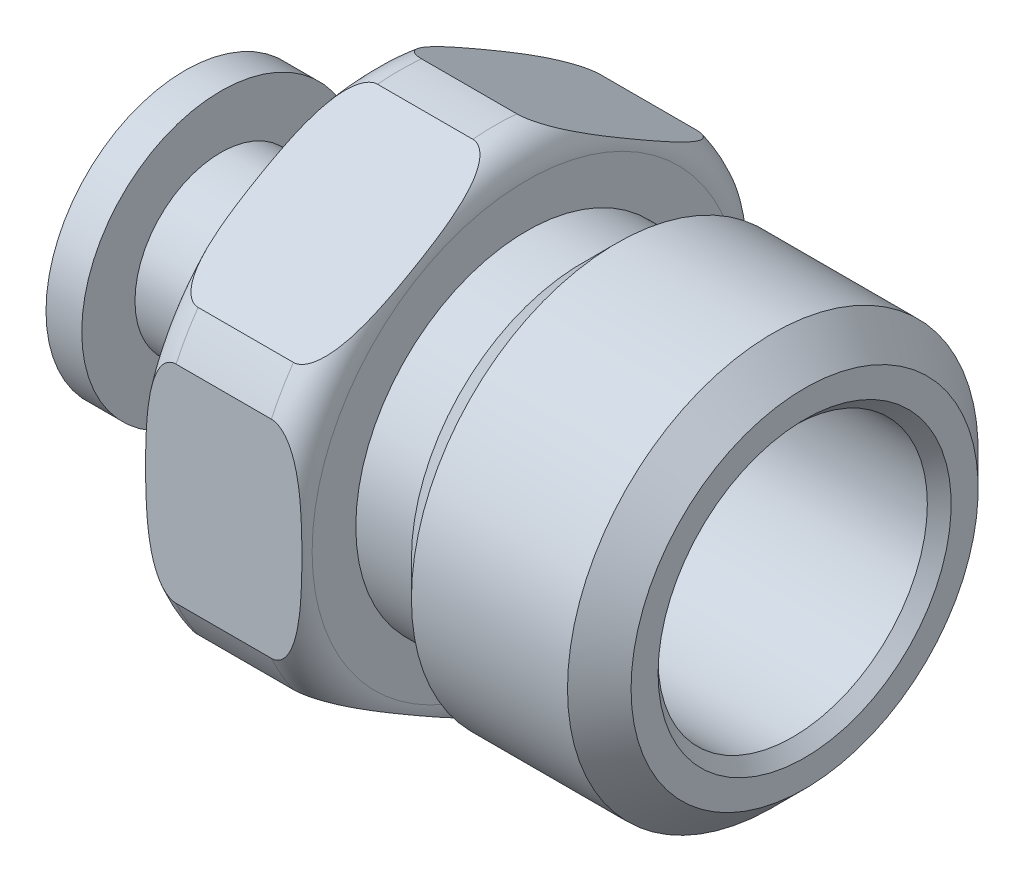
ISO-10303-21;
HEADER;
FILE_DESCRIPTION(('STEP AP214'),'2;1');
FILE_NAME('part.step','',(''),(''),'','','');
FILE_SCHEMA(('AUTOMOTIVE_DESIGN { 1 0 10303 214 1 1 1 1 }'));
ENDSEC;
DATA;
#1=APPLICATION_CONTEXT('core data for automotive mechanical design processes');
#2=APPLICATION_PROTOCOL_DEFINITION('international standard','automotive_design',2000,#1);
#3=PRODUCT_CONTEXT('',#1,'mechanical');
#4=PRODUCT('Part','Part','',(#3));
#5=PRODUCT_RELATED_PRODUCT_CATEGORY('part','',(#4));
#6=PRODUCT_DEFINITION_FORMATION('','',#4);
#7=PRODUCT_DEFINITION_CONTEXT('part definition',#1,'design');
#8=PRODUCT_DEFINITION('design','',#6,#7);
#9=PRODUCT_DEFINITION_SHAPE('','',#8);
#10=(LENGTH_UNIT() NAMED_UNIT(*) SI_UNIT(.MILLI.,.METRE.));
#11=(NAMED_UNIT(*) PLANE_ANGLE_UNIT() SI_UNIT($,.RADIAN.));
#12=(NAMED_UNIT(*) SI_UNIT($,.STERADIAN.) SOLID_ANGLE_UNIT());
#13=UNCERTAINTY_MEASURE_WITH_UNIT(LENGTH_MEASURE(1.E-05),#10,'distance_accuracy_value','');
#14=(GEOMETRIC_REPRESENTATION_CONTEXT(3) GLOBAL_UNCERTAINTY_ASSIGNED_CONTEXT((#13)) GLOBAL_UNIT_ASSIGNED_CONTEXT((#10,
#11,#12)) REPRESENTATION_CONTEXT('',''));
#15=CARTESIAN_POINT('',(0.,0.,0.));
#16=DIRECTION('',(0.,0.,1.));
#17=DIRECTION('',(1.,0.,0.));
#18=AXIS2_PLACEMENT_3D('',#15,#16,#17);
#19=CARTESIAN_POINT('',(0.,0.,0.));
#20=DIRECTION('',(-1.,0.,0.));
#21=DIRECTION('',(0.,0.,1.));
#22=AXIS2_PLACEMENT_3D('',#19,#20,#21);
#23=CYLINDRICAL_SURFACE('',#22,7.874);
#24=CARTESIAN_POINT('',(9.906,0.,0.));
#25=DIRECTION('',(-1.,0.,0.));
#26=DIRECTION('',(0.,0.,1.));
#27=AXIS2_PLACEMENT_3D('',#24,#25,#26);
#28=CIRCLE('',#27,7.874);
#29=CARTESIAN_POINT('',(9.906,3.31160262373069,7.14375));
#30=VERTEX_POINT('',#29);
#31=CARTESIAN_POINT('',(9.906,4.53086766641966,6.43980699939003));
#32=VERTEX_POINT('',#31);
#33=EDGE_CURVE('E151',#30,#32,#28,.T.);
#34=ORIENTED_EDGE('',*,*,#33,.T.);
#35=DIRECTION('',(-1.,0.,0.));
#36=VECTOR('',#35,1.);
#37=CARTESIAN_POINT('',(0.,4.53086766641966,6.43980699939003));
#38=LINE('',#37,#36);
#39=CARTESIAN_POINT('',(6.85800000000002,4.53086766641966,6.43980699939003));
#40=VERTEX_POINT('',#39);
#41=EDGE_CURVE('E137',#32,#40,#38,.T.);
#42=ORIENTED_EDGE('',*,*,#41,.T.);
#43=CARTESIAN_POINT('',(6.858,0.,0.));
#44=DIRECTION('',(-1.,0.,0.));
#45=DIRECTION('',(0.,0.,1.));
#46=AXIS2_PLACEMENT_3D('',#43,#44,#45);
#47=CIRCLE('',#46,7.874);
#48=CARTESIAN_POINT('',(6.858,3.31160262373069,7.14375));
#49=VERTEX_POINT('',#48);
#50=EDGE_CURVE('E149',#49,#40,#47,.T.);
#51=ORIENTED_EDGE('',*,*,#50,.F.);
#52=DIRECTION('',(-1.,0.,0.));
#53=VECTOR('',#52,1.);
#54=CARTESIAN_POINT('',(0.,3.31160262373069,7.14375));
#55=LINE('',#54,#53);
#56=EDGE_CURVE('E500',#49,#30,#55,.F.);
#57=ORIENTED_EDGE('',*,*,#56,.T.);
#58=EDGE_LOOP('',(#34,#42,#51,#57));
#59=FACE_BOUND('',#58,.T.);
#60=ADVANCED_FACE('F16',(#59),#23,.T.);
#61=CARTESIAN_POINT('',(6.858,7.84247029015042,0.703943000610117));
#62=VERTEX_POINT('',#61);
#63=CARTESIAN_POINT('',(6.85800000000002,7.84247029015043,-0.703943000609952));
#64=VERTEX_POINT('',#63);
#65=EDGE_CURVE('E161',#62,#64,#47,.T.);
#66=ORIENTED_EDGE('',*,*,#65,.F.);
#67=DIRECTION('',(-1.,0.,0.));
#68=VECTOR('',#67,1.);
#69=CARTESIAN_POINT('',(0.,7.84247029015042,0.703943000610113));
#70=LINE('',#69,#68);
#71=CARTESIAN_POINT('',(9.906,7.84247029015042,0.703943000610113));
#72=VERTEX_POINT('',#71);
#73=EDGE_CURVE('E37',#62,#72,#70,.F.);
#74=ORIENTED_EDGE('',*,*,#73,.T.);
#75=CARTESIAN_POINT('',(9.906,7.84247029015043,-0.703943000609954));
#76=VERTEX_POINT('',#75);
#77=EDGE_CURVE('E462',#72,#76,#28,.T.);
#78=ORIENTED_EDGE('',*,*,#77,.T.);
#79=DIRECTION('',(-1.,0.,0.));
#80=VECTOR('',#79,1.);
#81=CARTESIAN_POINT('',(0.,7.84247029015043,-0.703943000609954));
#82=LINE('',#81,#80);
#83=EDGE_CURVE('E306',#76,#64,#82,.T.);
#84=ORIENTED_EDGE('',*,*,#83,.T.);
#85=EDGE_LOOP('',(#66,#74,#78,#84));
#86=FACE_BOUND('',#85,.T.);
#87=ADVANCED_FACE('F354',(#86),#23,.T.);
#88=CARTESIAN_POINT('',(6.858,4.5308676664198,-6.43980699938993));
#89=VERTEX_POINT('',#88);
#90=CARTESIAN_POINT('',(6.85800000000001,3.31160262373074,-7.14374999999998));
#91=VERTEX_POINT('',#90);
#92=EDGE_CURVE('E173',#89,#91,#47,.T.);
#93=ORIENTED_EDGE('',*,*,#92,.F.);
#94=DIRECTION('',(-1.,0.,0.));
#95=VECTOR('',#94,1.);
#96=CARTESIAN_POINT('',(0.,4.5308676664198,-6.43980699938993));
#97=LINE('',#96,#95);
#98=CARTESIAN_POINT('',(9.906,4.5308676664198,-6.43980699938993));
#99=VERTEX_POINT('',#98);
#100=EDGE_CURVE('E47',#89,#99,#97,.F.);
#101=ORIENTED_EDGE('',*,*,#100,.T.);
#102=CARTESIAN_POINT('',(9.906,3.31160262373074,-7.14374999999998));
#103=VERTEX_POINT('',#102);
#104=EDGE_CURVE('E468',#99,#103,#28,.T.);
#105=ORIENTED_EDGE('',*,*,#104,.T.);
#106=DIRECTION('',(-1.,0.,0.));
#107=VECTOR('',#106,1.);
#108=CARTESIAN_POINT('',(0.,3.31160262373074,-7.14374999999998));
#109=LINE('',#108,#107);
#110=EDGE_CURVE('E311',#103,#91,#109,.T.);
#111=ORIENTED_EDGE('',*,*,#110,.T.);
#112=EDGE_LOOP('',(#93,#101,#105,#111));
#113=FACE_BOUND('',#112,.T.);
#114=ADVANCED_FACE('F359',(#113),#23,.T.);
#115=CARTESIAN_POINT('',(6.858,-3.31160262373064,-7.14375000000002));
#116=VERTEX_POINT('',#115);
#117=CARTESIAN_POINT('',(6.85800000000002,-4.53086766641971,-6.43980699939));
#118=VERTEX_POINT('',#117);
#119=EDGE_CURVE('E184',#116,#118,#47,.T.);
#120=ORIENTED_EDGE('',*,*,#119,.F.);
#121=DIRECTION('',(-1.,0.,0.));
#122=VECTOR('',#121,1.);
#123=CARTESIAN_POINT('',(0.,-3.31160262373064,-7.14375000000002));
#124=LINE('',#123,#122);
#125=CARTESIAN_POINT('',(9.906,-3.31160262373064,-7.14375000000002));
#126=VERTEX_POINT('',#125);
#127=EDGE_CURVE('E305',#116,#126,#124,.F.);
#128=ORIENTED_EDGE('',*,*,#127,.T.);
#129=CARTESIAN_POINT('',(9.906,-4.53086766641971,-6.43980699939));
#130=VERTEX_POINT('',#129);
#131=EDGE_CURVE('E473',#126,#130,#28,.T.);
#132=ORIENTED_EDGE('',*,*,#131,.T.);
#133=DIRECTION('',(-1.,0.,0.));
#134=VECTOR('',#133,1.);
#135=CARTESIAN_POINT('',(0.,-4.53086766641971,-6.43980699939));
#136=LINE('',#135,#134);
#137=EDGE_CURVE('E326',#130,#118,#136,.T.);
#138=ORIENTED_EDGE('',*,*,#137,.T.);
#139=EDGE_LOOP('',(#120,#128,#132,#138));
#140=FACE_BOUND('',#139,.T.);
#141=ADVANCED_FACE('F372',(#140),#23,.T.);
#142=CARTESIAN_POINT('',(6.858,-7.84247029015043,-0.703943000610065));
#143=VERTEX_POINT('',#142);
#144=CARTESIAN_POINT('',(6.85800000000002,-7.84247029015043,0.703943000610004));
#145=VERTEX_POINT('',#144);
#146=EDGE_CURVE('E176',#143,#145,#47,.T.);
#147=ORIENTED_EDGE('',*,*,#146,.F.);
#148=DIRECTION('',(-1.,0.,0.));
#149=VECTOR('',#148,1.);
#150=CARTESIAN_POINT('',(0.,-7.84247029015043,-0.703943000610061));
#151=LINE('',#150,#149);
#152=CARTESIAN_POINT('',(9.906,-7.84247029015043,-0.703943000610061));
#153=VERTEX_POINT('',#152);
#154=EDGE_CURVE('E322',#143,#153,#151,.F.);
#155=ORIENTED_EDGE('',*,*,#154,.T.);
#156=CARTESIAN_POINT('',(9.906,-7.84247029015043,0.703943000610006));
#157=VERTEX_POINT('',#156);
#158=EDGE_CURVE('E170',#153,#157,#28,.T.);
#159=ORIENTED_EDGE('',*,*,#158,.T.);
#160=DIRECTION('',(-1.,0.,0.));
#161=VECTOR('',#160,1.);
#162=CARTESIAN_POINT('',(0.,-7.84247029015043,0.703943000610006));
#163=LINE('',#162,#161);
#164=EDGE_CURVE('E386',#157,#145,#163,.T.);
#165=ORIENTED_EDGE('',*,*,#164,.T.);
#166=EDGE_LOOP('',(#147,#155,#159,#165));
#167=FACE_BOUND('',#166,.T.);
#168=ADVANCED_FACE('F363',(#167),#23,.T.);
#169=CARTESIAN_POINT('',(19.812,0.,0.));
#170=DIRECTION('',(-1.,0.,0.));
#171=DIRECTION('',(0.,0.,1.));
#172=AXIS2_PLACEMENT_3D('',#169,#170,#171);
#173=PLANE('',#172);
#174=CARTESIAN_POINT('',(19.812,0.,0.));
#175=DIRECTION('',(-1.,0.,0.));
#176=DIRECTION('',(0.,0.,1.));
#177=AXIS2_PLACEMENT_3D('',#174,#175,#176);
#178=CIRCLE('',#177,4.68629999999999);
#179=CARTESIAN_POINT('',(19.812,0.,4.68629999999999));
#180=VERTEX_POINT('',#179);
#181=EDGE_CURVE('E811',#180,#180,#178,.T.);
#182=ORIENTED_EDGE('',*,*,#181,.T.);
#183=EDGE_LOOP('',(#182));
#184=FACE_BOUND('',#183,.T.);
#185=CARTESIAN_POINT('',(19.812,0.,0.));
#186=DIRECTION('',(-1.,0.,0.));
#187=DIRECTION('',(0.,0.,1.));
#188=AXIS2_PLACEMENT_3D('',#185,#186,#187);
#189=CIRCLE('',#188,5.5499);
#190=CARTESIAN_POINT('',(19.812,0.,5.5499));
#191=VERTEX_POINT('',#190);
#192=EDGE_CURVE('E10',#191,#191,#189,.F.);
#193=ORIENTED_EDGE('',*,*,#192,.T.);
#194=EDGE_LOOP('',(#193));
#195=FACE_BOUND('',#194,.T.);
#196=ADVANCED_FACE('F371',(#184,#195),#173,.F.);
#197=CARTESIAN_POINT('',(0.,0.,0.));
#198=DIRECTION('',(-1.,0.,0.));
#199=DIRECTION('',(0.,0.,1.));
#200=AXIS2_PLACEMENT_3D('',#197,#198,#199);
#201=CYLINDRICAL_SURFACE('',#200,6.5659);
#202=CARTESIAN_POINT('',(18.796,0.,0.));
#203=DIRECTION('',(-1.,0.,0.));
#204=DIRECTION('',(0.,0.,1.));
#205=AXIS2_PLACEMENT_3D('',#202,#203,#204);
#206=CIRCLE('',#205,6.5659);
#207=CARTESIAN_POINT('',(18.796,0.,6.5659));
#208=VERTEX_POINT('',#207);
#209=EDGE_CURVE('E25',#208,#208,#206,.T.);
#210=ORIENTED_EDGE('',*,*,#209,.T.);
#211=EDGE_LOOP('',(#210));
#212=FACE_BOUND('',#211,.T.);
#213=CARTESIAN_POINT('',(13.8049,0.,0.));
#214=DIRECTION('',(-1.,0.,0.));
#215=DIRECTION('',(0.,0.,1.));
#216=AXIS2_PLACEMENT_3D('',#213,#214,#215);
#217=CIRCLE('',#216,6.5659);
#218=CARTESIAN_POINT('',(13.8049,0.,6.5659));
#219=VERTEX_POINT('',#218);
#220=EDGE_CURVE('E245',#219,#219,#217,.T.);
#221=ORIENTED_EDGE('',*,*,#220,.F.);
#222=EDGE_LOOP('',(#221));
#223=FACE_BOUND('',#222,.T.);
#224=ADVANCED_FACE('F379',(#212,#223),#201,.T.);
#225=CARTESIAN_POINT('',(13.8049,0.,0.));
#226=DIRECTION('',(1.,0.,0.));
#227=DIRECTION('',(0.,0.,-1.));
#228=AXIS2_PLACEMENT_3D('',#225,#226,#227);
#229=CONICAL_SURFACE('',#228,6.5659,0.78539816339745);
#230=CARTESIAN_POINT('',(12.7,0.,0.));
#231=DIRECTION('',(-1.,0.,0.));
#232=DIRECTION('',(0.,0.,1.));
#233=AXIS2_PLACEMENT_3D('',#230,#231,#232);
#234=CIRCLE('',#233,5.461);
#235=CARTESIAN_POINT('',(12.7,0.,5.461));
#236=VERTEX_POINT('',#235);
#237=EDGE_CURVE('E423',#236,#236,#234,.T.);
#238=ORIENTED_EDGE('',*,*,#237,.F.);
#239=EDGE_LOOP('',(#238));
#240=FACE_BOUND('',#239,.T.);
#241=ORIENTED_EDGE('',*,*,#220,.T.);
#242=EDGE_LOOP('',(#241));
#243=FACE_BOUND('',#242,.T.);
#244=ADVANCED_FACE('F726',(#240,#243),#229,.T.);
#245=CARTESIAN_POINT('',(0.,0.,0.));
#246=DIRECTION('',(-1.,0.,0.));
#247=DIRECTION('',(0.,0.,1.));
#248=AXIS2_PLACEMENT_3D('',#245,#246,#247);
#249=CYLINDRICAL_SURFACE('',#248,5.461);
#250=CARTESIAN_POINT('',(10.922,0.,0.));
#251=DIRECTION('',(-1.,0.,0.));
#252=DIRECTION('',(0.,0.,1.));
#253=AXIS2_PLACEMENT_3D('',#250,#251,#252);
#254=CIRCLE('',#253,5.461);
#255=CARTESIAN_POINT('',(10.922,0.,5.461));
#256=VERTEX_POINT('',#255);
#257=EDGE_CURVE('E442',#256,#256,#254,.T.);
#258=ORIENTED_EDGE('',*,*,#257,.F.);
#259=EDGE_LOOP('',(#258));
#260=FACE_BOUND('',#259,.T.);
#261=ORIENTED_EDGE('',*,*,#237,.T.);
#262=EDGE_LOOP('',(#261));
#263=FACE_BOUND('',#262,.T.);
#264=ADVANCED_FACE('F731',(#260,#263),#249,.T.);
#265=CARTESIAN_POINT('',(10.922,5.461,0.));
#266=DIRECTION('',(-1.,0.,0.));
#267=DIRECTION('',(0.,0.,1.));
#268=AXIS2_PLACEMENT_3D('',#265,#266,#267);
#269=PLANE('',#268);
#270=CARTESIAN_POINT('',(10.922,0.,0.));
#271=DIRECTION('',(-1.,0.,0.));
#272=DIRECTION('',(0.,0.,1.));
#273=AXIS2_PLACEMENT_3D('',#270,#271,#272);
#274=CIRCLE('',#273,6.858);
#275=CARTESIAN_POINT('',(10.922,0.,6.858));
#276=VERTEX_POINT('',#275);
#277=EDGE_CURVE('E447',#276,#276,#274,.T.);
#278=ORIENTED_EDGE('',*,*,#277,.F.);
#279=EDGE_LOOP('',(#278));
#280=FACE_BOUND('',#279,.T.);
#281=ORIENTED_EDGE('',*,*,#257,.T.);
#282=EDGE_LOOP('',(#281));
#283=FACE_BOUND('',#282,.T.);
#284=ADVANCED_FACE('F368',(#280,#283),#269,.F.);
#285=CARTESIAN_POINT('',(9.906,0.,0.));
#286=DIRECTION('',(-1.,0.,0.));
#287=DIRECTION('',(0.,0.,1.));
#288=AXIS2_PLACEMENT_3D('',#285,#286,#287);
#289=TOROIDAL_SURFACE('',#288,6.858,1.016);
#290=ORIENTED_EDGE('',*,*,#77,.F.);
#291=CARTESIAN_POINT('',(9.9058,7.84247026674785,0.703943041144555));
#292=CARTESIAN_POINT('',(9.93189972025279,7.84250982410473,0.703874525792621));
#293=CARTESIAN_POINT('',(9.95792484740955,7.84128881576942,0.705989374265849));
#294=CARTESIAN_POINT('',(10.0089231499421,7.83662120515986,0.714073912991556));
#295=CARTESIAN_POINT('',(10.0339039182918,7.83319564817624,0.7200071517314));
#296=CARTESIAN_POINT('',(10.0823464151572,7.82441930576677,0.735208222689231));
#297=CARTESIAN_POINT('',(10.1058128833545,7.81907490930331,0.744464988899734));
#298=CARTESIAN_POINT('',(10.1510862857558,7.80681749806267,0.76569544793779));
#299=CARTESIAN_POINT('',(10.1728889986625,7.79990065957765,0.777675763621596));
#300=CARTESIAN_POINT('',(10.2299863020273,7.7793373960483,0.813292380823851));
#301=CARTESIAN_POINT('',(10.263509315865,7.76446472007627,0.839052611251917));
#302=CARTESIAN_POINT('',(10.3256760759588,7.73235652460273,0.894665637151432));
#303=CARTESIAN_POINT('',(10.3543039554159,7.71511363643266,0.924531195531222));
#304=CARTESIAN_POINT('',(10.4052391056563,7.68054292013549,0.984409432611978));
#305=CARTESIAN_POINT('',(10.4278684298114,7.66333162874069,1.01422026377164));
#306=CARTESIAN_POINT('',(10.4701250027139,7.6280018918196,1.075413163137));
#307=CARTESIAN_POINT('',(10.4897494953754,7.60988263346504,1.10679663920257));
#308=CARTESIAN_POINT('',(10.526444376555,7.57300100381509,1.17067749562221));
#309=CARTESIAN_POINT('',(10.5435131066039,7.55423822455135,1.20317558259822));
#310=CARTESIAN_POINT('',(10.5754480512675,7.51626403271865,1.26894881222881));
#311=CARTESIAN_POINT('',(10.590315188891,7.4970528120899,1.30222362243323));
#312=CARTESIAN_POINT('',(10.6257038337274,7.44780981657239,1.38751499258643));
#313=CARTESIAN_POINT('',(10.6449335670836,7.41754636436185,1.43993282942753));
#314=CARTESIAN_POINT('',(10.6798081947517,7.35650218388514,1.54566445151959));
#315=CARTESIAN_POINT('',(10.6954510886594,7.32572117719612,1.59897871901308));
#316=CARTESIAN_POINT('',(10.7380790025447,7.23276398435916,1.75998529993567));
#317=CARTESIAN_POINT('',(10.7606872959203,7.17008862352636,1.8685422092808));
#318=CARTESIAN_POINT('',(10.7982307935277,7.0434822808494,2.08783082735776));
#319=CARTESIAN_POINT('',(10.8130750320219,6.97954514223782,2.19857319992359));
#320=CARTESIAN_POINT('',(10.8371837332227,6.85152431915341,2.42031176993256));
#321=CARTESIAN_POINT('',(10.8464573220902,6.7874410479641,2.53130725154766));
#322=CARTESIAN_POINT('',(10.8623466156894,6.64895973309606,2.77116392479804));
#323=CARTESIAN_POINT('',(10.8683039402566,6.5745441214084,2.90005554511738));
#324=CARTESIAN_POINT('',(10.8767365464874,6.42565430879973,3.157940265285));
#325=CARTESIAN_POINT('',(10.8792111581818,6.35118009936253,3.28693337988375));
#326=CARTESIAN_POINT('',(10.8814349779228,6.20192099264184,3.54545773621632));
#327=CARTESIAN_POINT('',(10.8811731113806,6.12713605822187,3.67498904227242));
#328=CARTESIAN_POINT('',(10.8778169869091,5.97760060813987,3.93399203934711));
#329=CARTESIAN_POINT('',(10.8747235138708,5.90285008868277,4.06346373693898));
#330=CARTESIAN_POINT('',(10.8648484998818,5.75474471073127,4.31998977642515));
#331=CARTESIAN_POINT('',(10.8581338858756,5.68138879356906,4.44704595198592));
#332=CARTESIAN_POINT('',(10.8392996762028,5.53475575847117,4.70102181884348));
#333=CARTESIAN_POINT('',(10.82717472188,5.46147879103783,4.8279412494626));
#334=CARTESIAN_POINT('',(10.8028164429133,5.35215017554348,5.01730396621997));
#335=CARTESIAN_POINT('',(10.7937094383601,5.31592604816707,5.08004599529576));
#336=CARTESIAN_POINT('',(10.7729400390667,5.24366356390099,5.20520828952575));
#337=CARTESIAN_POINT('',(10.7612780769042,5.20762517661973,5.26762860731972));
#338=CARTESIAN_POINT('',(10.7348044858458,5.13590168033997,5.39185734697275));
#339=CARTESIAN_POINT('',(10.7199985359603,5.10021605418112,5.45366666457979));
#340=CARTESIAN_POINT('',(10.6864315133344,5.02931876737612,5.57646436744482));
#341=CARTESIAN_POINT('',(10.6676726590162,4.99410685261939,5.63745319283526));
#342=CARTESIAN_POINT('',(10.6376662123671,4.94498216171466,5.72253965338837));
#343=CARTESIAN_POINT('',(10.6285086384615,4.9307486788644,5.74719276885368));
#344=CARTESIAN_POINT('',(10.6092452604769,4.90243754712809,5.79622908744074));
#345=CARTESIAN_POINT('',(10.5991391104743,4.88835995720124,5.82061218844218));
#346=CARTESIAN_POINT('',(10.5671563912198,4.84630736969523,5.89344940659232));
#347=CARTESIAN_POINT('',(10.5436831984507,4.81862661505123,5.94139388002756));
#348=CARTESIAN_POINT('',(10.4852767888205,4.75809374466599,6.04623988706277));
#349=CARTESIAN_POINT('',(10.4489459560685,4.72557216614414,6.10256891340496));
#350=CARTESIAN_POINT('',(10.3654916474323,4.66419093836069,6.20888431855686));
#351=CARTESIAN_POINT('',(10.3184434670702,4.63530782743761,6.25891133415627));
#352=CARTESIAN_POINT('',(10.2423340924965,4.59979127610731,6.32042780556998));
#353=CARTESIAN_POINT('',(10.2190449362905,4.59008691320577,6.33723625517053));
#354=CARTESIAN_POINT('',(10.1699725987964,4.57236092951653,6.36793855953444));
#355=CARTESIAN_POINT('',(10.144188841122,4.56433969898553,6.38183173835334));
#356=CARTESIAN_POINT('',(10.0899220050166,4.55044375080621,6.40590022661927));
#357=CARTESIAN_POINT('',(10.0614075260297,4.54459907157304,6.41602350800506));
#358=CARTESIAN_POINT('',(10.0026583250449,4.5358384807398,6.43119729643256));
#359=CARTESIAN_POINT('',(9.9724305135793,4.53291158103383,6.43626683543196));
#360=CARTESIAN_POINT('',(9.93597036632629,4.53137161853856,6.43893412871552));
#361=CARTESIAN_POINT('',(9.92994079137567,4.53118152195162,6.43926338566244));
#362=CARTESIAN_POINT('',(9.91787495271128,4.53092910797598,6.4397005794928));
#363=CARTESIAN_POINT('',(9.91183869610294,4.53086670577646,6.43980866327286));
#364=CARTESIAN_POINT('',(9.9058,4.53086768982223,6.4398069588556));
#365=B_SPLINE_CURVE_WITH_KNOTS('',3,(#291,#292,#293,#294,#295,#296,#297,#298,#299,#300,#301,
#302,#303,#304,#305,#306,#307,#308,#309,#310,#311,#312,#313,#314,#315,#316,#317,#318,#319,#320,
#321,#322,#323,#324,#325,#326,#327,#328,#329,#330,#331,#332,#333,#334,#335,#336,#337,#338,#339,
#340,#341,#342,#343,#344,#345,#346,#347,#348,#349,#350,#351,#352,#353,#354,#355,#356,#357,#358,
#359,#360,#361,#362,#363,#364),.UNSPECIFIED.,.F.,.F.,(4,2,2,2,2,2,2,2,2,2,2,2,2,2,2,2,2,2,2,2,2,
2,2,2,2,2,2,2,2,2,2,2,2,2,2,2,4),(0.,0.0780637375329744,0.155393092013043,0.232467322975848,
0.309731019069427,0.443405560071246,0.577505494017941,0.700906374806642,0.824419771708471,
0.948012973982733,1.07155421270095,1.26192485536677,1.45240141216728,1.83407783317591,
2.2201311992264,2.60555037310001,3.05234265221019,3.49922086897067,3.9479083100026,
4.39647141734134,4.83701476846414,5.27799542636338,5.49701639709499,5.71600031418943,
5.93459199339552,6.15306132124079,6.24275774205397,6.33248700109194,6.5126577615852,
6.73555956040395,6.95694117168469,7.04766700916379,7.1384138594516,7.23037036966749,
7.32197925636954,7.34010104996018,7.35821080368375),.UNSPECIFIED.);
#366=EDGE_CURVE('E153',#72,#32,#365,.T.);
#367=ORIENTED_EDGE('',*,*,#366,.T.);
#368=ORIENTED_EDGE('',*,*,#33,.F.);
#369=CARTESIAN_POINT('',(10.8780415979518,0.375651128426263,7.14375));
#370=CARTESIAN_POINT('',(10.8807574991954,0.206120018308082,7.14375));
#371=CARTESIAN_POINT('',(10.8815574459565,0.0365570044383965,7.14375));
#372=CARTESIAN_POINT('',(10.8796923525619,-0.302596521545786,7.14375));
#373=CARTESIAN_POINT('',(10.8770262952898,-0.472187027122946,7.14375));
#374=CARTESIAN_POINT('',(10.8671537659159,-0.811483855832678,7.14375));
#375=CARTESIAN_POINT('',(10.859941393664,-0.981190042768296,7.14375));
#376=CARTESIAN_POINT('',(10.8437330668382,-1.23537075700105,7.14375));
#377=CARTESIAN_POINT('',(10.8374341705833,-1.32001414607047,7.14375));
#378=CARTESIAN_POINT('',(10.8225213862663,-1.48909352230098,7.14375));
#379=CARTESIAN_POINT('',(10.8139077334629,-1.57352952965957,7.14375));
#380=CARTESIAN_POINT('',(10.7936729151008,-1.74251420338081,7.14375));
#381=CARTESIAN_POINT('',(10.782035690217,-1.82706099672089,7.14375));
#382=CARTESIAN_POINT('',(10.754915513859,-1.99559536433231,7.14375));
#383=CARTESIAN_POINT('',(10.7394305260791,-2.07958261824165,7.14375));
#384=CARTESIAN_POINT('',(10.7034729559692,-2.24654818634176,7.14375));
#385=CARTESIAN_POINT('',(10.6829986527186,-2.32952614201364,7.14375));
#386=CARTESIAN_POINT('',(10.6355253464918,-2.49351536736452,7.14375));
#387=CARTESIAN_POINT('',(10.6085344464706,-2.57452894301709,7.14375));
#388=CARTESIAN_POINT('',(10.5453437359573,-2.73424000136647,7.14375));
#389=CARTESIAN_POINT('',(10.50903699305,-2.81289786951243,7.14375));
#390=CARTESIAN_POINT('',(10.4452842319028,-2.92534459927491,7.14375));
#391=CARTESIAN_POINT('',(10.4225674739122,-2.96180108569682,7.14375));
#392=CARTESIAN_POINT('',(10.3734339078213,-3.03210075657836,7.14375));
#393=CARTESIAN_POINT('',(10.3470238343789,-3.06594852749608,7.14375));
#394=CARTESIAN_POINT('',(10.297763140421,-3.1209417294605,7.14375));
#395=CARTESIAN_POINT('',(10.2759500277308,-3.14301020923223,7.14375));
#396=CARTESIAN_POINT('',(10.2297941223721,-3.18441418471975,7.14375));
#397=CARTESIAN_POINT('',(10.2054492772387,-3.20374743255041,7.14375));
#398=CARTESIAN_POINT('',(10.153877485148,-3.23885586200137,7.14375));
#399=CARTESIAN_POINT('',(10.1266220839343,-3.25459007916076,7.14375));
#400=CARTESIAN_POINT('',(10.0697310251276,-3.28091900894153,7.14375));
#401=CARTESIAN_POINT('',(10.0401008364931,-3.29152515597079,7.14375));
#402=CARTESIAN_POINT('',(9.98596063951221,-3.30477751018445,7.14375));
#403=CARTESIAN_POINT('',(9.96175339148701,-3.30865951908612,7.14375));
#404=CARTESIAN_POINT('',(9.91303165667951,-3.31223854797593,7.14375));
#405=CARTESIAN_POINT('',(9.8885173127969,-3.31193744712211,7.14375));
#406=CARTESIAN_POINT('',(9.83993841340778,-3.30718149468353,7.14375));
#407=CARTESIAN_POINT('',(9.81587327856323,-3.30273243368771,7.14375));
#408=CARTESIAN_POINT('',(9.76875842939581,-3.29007440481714,7.14375));
#409=CARTESIAN_POINT('',(9.74570948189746,-3.28186264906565,7.14375));
#410=CARTESIAN_POINT('',(9.69270995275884,-3.25860457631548,7.14375));
#411=CARTESIAN_POINT('',(9.66337901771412,-3.24215235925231,7.14375));
#412=CARTESIAN_POINT('',(9.60771581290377,-3.20479134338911,7.14375));
#413=CARTESIAN_POINT('',(9.5813906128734,-3.18387235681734,7.14375));
#414=CARTESIAN_POINT('',(9.51663956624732,-3.12526659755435,7.14375));
#415=CARTESIAN_POINT('',(9.48049816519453,-3.08507908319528,7.14375));
#416=CARTESIAN_POINT('',(9.41448983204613,-2.99990101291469,7.14375));
#417=CARTESIAN_POINT('',(9.38463848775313,-2.95489893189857,7.14375));
#418=CARTESIAN_POINT('',(9.3300965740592,-2.86207983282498,7.14375));
#419=CARTESIAN_POINT('',(9.30539247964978,-2.81427062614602,7.14375));
#420=CARTESIAN_POINT('',(9.26006123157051,-2.71673260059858,7.14375));
#421=CARTESIAN_POINT('',(9.23943842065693,-2.66700180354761,7.14375));
#422=CARTESIAN_POINT('',(9.20151300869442,-2.5661988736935,7.14375));
#423=CARTESIAN_POINT('',(9.18421678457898,-2.51512437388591,7.14375));
#424=CARTESIAN_POINT('',(9.15242664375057,-2.41215639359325,7.14375));
#425=CARTESIAN_POINT('',(9.13793107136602,-2.36026341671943,7.14375));
#426=CARTESIAN_POINT('',(9.09979590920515,-2.21103324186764,7.14375));
#427=CARTESIAN_POINT('',(9.07900479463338,-2.11297021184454,7.14375));
#428=CARTESIAN_POINT('',(9.04326349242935,-1.91576570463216,7.14375));
#429=CARTESIAN_POINT('',(9.0283177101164,-1.81662347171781,7.14375));
#430=CARTESIAN_POINT('',(9.00275317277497,-1.61753871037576,7.14375));
#431=CARTESIAN_POINT('',(8.99214557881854,-1.51759478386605,7.14375));
#432=CARTESIAN_POINT('',(8.97420194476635,-1.31741104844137,7.14375));
#433=CARTESIAN_POINT('',(8.96686637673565,-1.2171711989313,7.14375));
#434=CARTESIAN_POINT('',(8.95460017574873,-1.01567020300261,7.14375));
#435=CARTESIAN_POINT('',(8.94969112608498,-0.91440778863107,7.14375));
#436=CARTESIAN_POINT('',(8.94177269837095,-0.711805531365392,7.14375));
#437=CARTESIAN_POINT('',(8.93876344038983,-0.610465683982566,7.14375));
#438=CARTESIAN_POINT('',(8.93425137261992,-0.407948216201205,7.14375));
#439=CARTESIAN_POINT('',(8.93274568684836,-0.306770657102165,7.14375));
#440=CARTESIAN_POINT('',(8.93102038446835,-0.104408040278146,7.14375));
#441=CARTESIAN_POINT('',(8.93080073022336,-0.00322298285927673,7.14375));
#442=CARTESIAN_POINT('',(8.93161258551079,0.198276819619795,7.14375));
#443=CARTESIAN_POINT('',(8.93263340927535,0.298591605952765,7.14375));
#444=CARTESIAN_POINT('',(8.93605049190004,0.499198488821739,7.14375));
#445=CARTESIAN_POINT('',(8.93844674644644,0.599490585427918,7.14375));
#446=CARTESIAN_POINT('',(8.94494055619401,0.800267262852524,7.14375));
#447=CARTESIAN_POINT('',(8.94904225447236,0.900751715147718,7.14375));
#448=CARTESIAN_POINT('',(8.95945610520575,1.10160096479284,7.14375));
#449=CARTESIAN_POINT('',(8.96576804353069,1.20196577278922,7.14375));
#450=CARTESIAN_POINT('',(8.98125435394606,1.40154690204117,7.14375));
#451=CARTESIAN_POINT('',(8.99040168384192,1.50076525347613,7.14375));
#452=CARTESIAN_POINT('',(9.0125331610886,1.69876936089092,7.14375));
#453=CARTESIAN_POINT('',(9.02551651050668,1.79755520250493,7.14375));
#454=CARTESIAN_POINT('',(9.05656843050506,1.99397827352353,7.14375));
#455=CARTESIAN_POINT('',(9.07461852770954,2.0916183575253,7.14375));
#456=CARTESIAN_POINT('',(9.11759054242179,2.28534633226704,7.14375));
#457=CARTESIAN_POINT('',(9.14250462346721,2.38143586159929,7.14375));
#458=CARTESIAN_POINT('',(9.18649732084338,2.52168255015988,7.14375));
#459=CARTESIAN_POINT('',(9.20192466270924,2.56698376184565,7.14375));
#460=CARTESIAN_POINT('',(9.23543685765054,2.65664412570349,7.14375));
#461=CARTESIAN_POINT('',(9.25352363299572,2.70100256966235,7.14375));
#462=CARTESIAN_POINT('',(9.29275015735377,2.78807894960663,7.14375));
#463=CARTESIAN_POINT('',(9.31387306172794,2.83080439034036,7.14375));
#464=CARTESIAN_POINT('',(9.35986221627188,2.91416497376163,7.14375));
#465=CARTESIAN_POINT('',(9.38472352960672,2.95480277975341,7.14375));
#466=CARTESIAN_POINT('',(9.43233445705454,3.02336403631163,7.14375));
#467=CARTESIAN_POINT('',(9.45410621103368,3.05196112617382,7.14375));
#468=CARTESIAN_POINT('',(9.5006702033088,3.10669754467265,7.14375));
#469=CARTESIAN_POINT('',(9.52546671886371,3.13283329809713,7.14375));
#470=CARTESIAN_POINT('',(9.5787080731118,3.18180378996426,7.14375));
#471=CARTESIAN_POINT('',(9.60719069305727,3.20459824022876,7.14375));
#472=CARTESIAN_POINT('',(9.66769357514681,3.24487982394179,7.14375));
#473=CARTESIAN_POINT('',(9.69970307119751,3.26238253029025,7.14375));
#474=CARTESIAN_POINT('',(9.75650482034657,3.28589932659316,7.14375));
#475=CARTESIAN_POINT('',(9.78051738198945,3.29378946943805,7.14375));
#476=CARTESIAN_POINT('',(9.82952507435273,3.30545794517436,7.14375));
#477=CARTESIAN_POINT('',(9.85451932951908,3.30923985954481,7.14375));
#478=CARTESIAN_POINT('',(9.90486471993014,3.31234524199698,7.14375));
#479=CARTESIAN_POINT('',(9.93021670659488,3.31165517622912,7.14375));
#480=CARTESIAN_POINT('',(9.9804099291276,3.30585365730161,7.14375));
#481=CARTESIAN_POINT('',(10.0052509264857,3.30074018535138,7.14375));
#482=CARTESIAN_POINT('',(10.0530043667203,3.28677562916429,7.14375));
#483=CARTESIAN_POINT('',(10.0759526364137,3.27804443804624,7.14375));
#484=CARTESIAN_POINT('',(10.1203903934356,3.25746930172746,7.14375));
#485=CARTESIAN_POINT('',(10.1418793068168,3.24562414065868,7.14375));
#486=CARTESIAN_POINT('',(10.1969557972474,3.21075823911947,7.14375));
#487=CARTESIAN_POINT('',(10.2291428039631,3.18552826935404,7.14375));
#488=CARTESIAN_POINT('',(10.2892546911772,3.13041959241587,7.14375));
#489=CARTESIAN_POINT('',(10.3171661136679,3.10052678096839,7.14375));
#490=CARTESIAN_POINT('',(10.3891886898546,3.01357494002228,7.14375));
#491=CARTESIAN_POINT('',(10.4293205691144,2.95325414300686,7.14375));
#492=CARTESIAN_POINT('',(10.5007868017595,2.82768797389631,7.14375));
#493=CARTESIAN_POINT('',(10.5320971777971,2.76242978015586,7.14375));
#494=CARTESIAN_POINT('',(10.5799935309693,2.64827674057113,7.14375));
#495=CARTESIAN_POINT('',(10.5982270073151,2.60005695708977,7.14375));
#496=CARTESIAN_POINT('',(10.6318561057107,2.50263056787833,7.14375));
#497=CARTESIAN_POINT('',(10.647250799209,2.45342364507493,7.14375));
#498=CARTESIAN_POINT('',(10.6899371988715,2.30462593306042,7.14375));
#499=CARTESIAN_POINT('',(10.7136686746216,2.20401732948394,7.14375));
#500=CARTESIAN_POINT('',(10.7543914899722,2.00115375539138,7.14375));
#501=CARTESIAN_POINT('',(10.7713585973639,1.89889420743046,7.14375));
#502=CARTESIAN_POINT('',(10.8002639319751,1.693649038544,7.14375));
#503=CARTESIAN_POINT('',(10.8122004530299,1.59066318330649,7.14375));
#504=CARTESIAN_POINT('',(10.8313050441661,1.39501669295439,7.14375));
#505=CARTESIAN_POINT('',(10.8388386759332,1.30239010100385,7.14375));
#506=CARTESIAN_POINT('',(10.8516093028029,1.11696660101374,7.14375));
#507=CARTESIAN_POINT('',(10.8568459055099,1.02416966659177,7.14375));
#508=CARTESIAN_POINT('',(10.8655329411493,0.83877425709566,7.14375));
#509=CARTESIAN_POINT('',(10.8689886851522,0.746176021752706,7.14375));
#510=CARTESIAN_POINT('',(10.8745009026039,0.560938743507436,7.14375));
#511=CARTESIAN_POINT('',(10.8765573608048,0.468299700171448,7.14375));
#512=CARTESIAN_POINT('',(10.8780415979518,0.375651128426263,7.14375));
#513=B_SPLINE_CURVE_WITH_KNOTS('',3,(#369,#370,#371,#372,#373,#374,#375,#376,#377,#378,#379,
#380,#381,#382,#383,#384,#385,#386,#387,#388,#389,#390,#391,#392,#393,#394,#395,#396,#397,#398,
#399,#400,#401,#402,#403,#404,#405,#406,#407,#408,#409,#410,#411,#412,#413,#414,#415,#416,#417,
#418,#419,#420,#421,#422,#423,#424,#425,#426,#427,#428,#429,#430,#431,#432,#433,#434,#435,#436,
#437,#438,#439,#440,#441,#442,#443,#444,#445,#446,#447,#448,#449,#450,#451,#452,#453,#454,#455,
#456,#457,#458,#459,#460,#461,#462,#463,#464,#465,#466,#467,#468,#469,#470,#471,#472,#473,#474,
#475,#476,#477,#478,#479,#480,#481,#482,#483,#484,#485,#486,#487,#488,#489,#490,#491,#492,#493,
#494,#495,#496,#497,#498,#499,#500,#501,#502,#503,#504,#505,#506,#507,#508,#509,#510,#511,#512),
.UNSPECIFIED.,.T.,.F.,(4,2,2,2,2,2,2,2,2,2,2,2,2,2,2,2,2,2,2,2,2,2,2,2,2,2,2,2,2,2,2,2,2,2,2,2,
2,2,2,2,2,2,2,2,2,2,2,2,2,2,2,2,2,2,2,2,2,2,2,2,2,2,2,2,2,2,2,2,2,2,2,4),(0.,0.508652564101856,
1.01745442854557,1.52691797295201,1.78152664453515,2.03610944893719,2.29207310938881,
2.54817252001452,2.80436039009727,3.06023133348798,3.31918205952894,3.44787802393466,
3.57634230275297,3.6692561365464,3.7622458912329,3.85624653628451,3.95003660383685,
4.02325105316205,4.09643261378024,4.16951216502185,4.24264595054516,4.34296728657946,
4.44351992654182,4.60475212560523,4.76637930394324,4.92757627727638,5.08894386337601,
5.25061776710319,5.4121957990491,5.71264293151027,6.01331606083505,6.31475795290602,
6.61624332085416,6.92036412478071,7.22450414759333,7.52806130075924,7.83160957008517,
8.13256143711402,8.43351236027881,8.73519870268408,9.03685582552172,9.33572012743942,
9.63452230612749,9.93224889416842,10.2296369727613,10.3731419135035,10.5167510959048,
10.6595922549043,10.8022464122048,10.9099088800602,11.0177253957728,11.1267505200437,
11.2354516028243,11.3109700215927,11.3864225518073,11.4621035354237,11.5378190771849,
11.6112040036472,11.6846176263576,11.8065973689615,11.9289535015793,12.1450854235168,
12.3617992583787,12.51635640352,12.6709640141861,12.9806897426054,13.2915152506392,
13.6024460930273,13.881209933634,14.1600213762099,14.4379964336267,14.7159745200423),.UNSPECIFIED.);
#514=CARTESIAN_POINT('',(9.906,-3.31160262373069,7.14375));
#515=VERTEX_POINT('',#514);
#516=EDGE_CURVE('E209',#30,#515,#513,.T.);
#517=ORIENTED_EDGE('',*,*,#516,.T.);
#518=CARTESIAN_POINT('',(9.906,-4.53086766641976,6.43980699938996));
#519=VERTEX_POINT('',#518);
#520=EDGE_CURVE('E160',#519,#515,#28,.T.);
#521=ORIENTED_EDGE('',*,*,#520,.F.);
#522=CARTESIAN_POINT('',(9.9058,-4.53086768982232,6.43980695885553));
#523=CARTESIAN_POINT('',(9.93189972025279,-4.53082813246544,6.43987547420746));
#524=CARTESIAN_POINT('',(9.95792484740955,-4.53204914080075,6.43776062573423));
#525=CARTESIAN_POINT('',(10.0089231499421,-4.53671675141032,6.42967608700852));
#526=CARTESIAN_POINT('',(10.0339039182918,-4.54014230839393,6.42374284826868));
#527=CARTESIAN_POINT('',(10.0823464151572,-4.54891865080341,6.40854177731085));
#528=CARTESIAN_POINT('',(10.1058128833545,-4.55426304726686,6.39928501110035));
#529=CARTESIAN_POINT('',(10.1510862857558,-4.5665204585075,6.37805455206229));
#530=CARTESIAN_POINT('',(10.1728889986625,-4.57343729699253,6.36607423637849));
#531=CARTESIAN_POINT('',(10.2299863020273,-4.59400056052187,6.33045761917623));
#532=CARTESIAN_POINT('',(10.263509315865,-4.60887323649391,6.30469738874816));
#533=CARTESIAN_POINT('',(10.3256760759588,-4.64098143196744,6.24908436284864));
#534=CARTESIAN_POINT('',(10.3543039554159,-4.65822432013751,6.21921880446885));
#535=CARTESIAN_POINT('',(10.4052391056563,-4.69279503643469,6.15934056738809));
#536=CARTESIAN_POINT('',(10.4278684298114,-4.71000632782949,6.12952973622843));
#537=CARTESIAN_POINT('',(10.4701250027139,-4.74533606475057,6.06833683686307));
#538=CARTESIAN_POINT('',(10.4897494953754,-4.76345532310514,6.0369533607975));
#539=CARTESIAN_POINT('',(10.526444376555,-4.80033695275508,5.97307250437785));
#540=CARTESIAN_POINT('',(10.5435131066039,-4.81909973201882,5.94057441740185));
#541=CARTESIAN_POINT('',(10.5754480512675,-4.85707392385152,5.87480118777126));
#542=CARTESIAN_POINT('',(10.590315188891,-4.87628514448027,5.84152637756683));
#543=CARTESIAN_POINT('',(10.6257038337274,-4.92552813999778,5.75623500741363));
#544=CARTESIAN_POINT('',(10.6449335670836,-4.95579159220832,5.70381717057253));
#545=CARTESIAN_POINT('',(10.6798081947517,-5.01683577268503,5.59808554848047));
#546=CARTESIAN_POINT('',(10.6954510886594,-5.04761677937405,5.54477128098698));
#547=CARTESIAN_POINT('',(10.7380790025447,-5.14057397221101,5.38376470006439));
#548=CARTESIAN_POINT('',(10.7606872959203,-5.20324933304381,5.27520779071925));
#549=CARTESIAN_POINT('',(10.7982307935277,-5.32985567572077,5.05591917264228));
#550=CARTESIAN_POINT('',(10.8130750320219,-5.39379281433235,4.94517680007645));
#551=CARTESIAN_POINT('',(10.8371837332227,-5.52181363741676,4.72343823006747));
#552=CARTESIAN_POINT('',(10.8464573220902,-5.58589690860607,4.61244274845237));
#553=CARTESIAN_POINT('',(10.8623466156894,-5.72437822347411,4.37258607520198));
#554=CARTESIAN_POINT('',(10.8683039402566,-5.79879383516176,4.24369445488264));
#555=CARTESIAN_POINT('',(10.8767365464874,-5.94768364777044,3.98580973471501));
#556=CARTESIAN_POINT('',(10.8792111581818,-6.02215785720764,3.85681662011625));
#557=CARTESIAN_POINT('',(10.8814349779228,-6.17141696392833,3.59829226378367));
#558=CARTESIAN_POINT('',(10.8811731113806,-6.2462018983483,3.46876095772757));
#559=CARTESIAN_POINT('',(10.8778169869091,-6.3957373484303,3.20975796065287));
#560=CARTESIAN_POINT('',(10.8747235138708,-6.4704878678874,3.080286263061));
#561=CARTESIAN_POINT('',(10.8648484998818,-6.6185932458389,2.82376022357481));
#562=CARTESIAN_POINT('',(10.8581338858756,-6.69194916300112,2.69670404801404));
#563=CARTESIAN_POINT('',(10.8392996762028,-6.838582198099,2.44272818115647));
#564=CARTESIAN_POINT('',(10.82717472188,-6.91185916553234,2.31580875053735));
#565=CARTESIAN_POINT('',(10.8028164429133,-7.02118778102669,2.12644603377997));
#566=CARTESIAN_POINT('',(10.7937094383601,-7.0574119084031,2.06370400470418));
#567=CARTESIAN_POINT('',(10.7729400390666,-7.12967439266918,1.93854171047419));
#568=CARTESIAN_POINT('',(10.7612780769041,-7.16571277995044,1.87612139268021));
#569=CARTESIAN_POINT('',(10.7348044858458,-7.2374362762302,1.75189265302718));
#570=CARTESIAN_POINT('',(10.7199985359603,-7.27312190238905,1.69008333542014));
#571=CARTESIAN_POINT('',(10.6864315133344,-7.34401918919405,1.56728563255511));
#572=CARTESIAN_POINT('',(10.6676726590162,-7.37923110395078,1.50629680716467));
#573=CARTESIAN_POINT('',(10.6376662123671,-7.42835579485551,1.42121034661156));
#574=CARTESIAN_POINT('',(10.6285086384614,-7.44258927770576,1.39655723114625));
#575=CARTESIAN_POINT('',(10.6092452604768,-7.47090040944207,1.3475209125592));
#576=CARTESIAN_POINT('',(10.5991391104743,-7.48497799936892,1.32313781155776));
#577=CARTESIAN_POINT('',(10.5671563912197,-7.52703058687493,1.25030059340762));
#578=CARTESIAN_POINT('',(10.5436831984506,-7.55471134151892,1.20235611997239));
#579=CARTESIAN_POINT('',(10.4852767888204,-7.61524421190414,1.09751011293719));
#580=CARTESIAN_POINT('',(10.4489459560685,-7.64776579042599,1.04118108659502));
#581=CARTESIAN_POINT('',(10.3654916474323,-7.70914701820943,0.93486568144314));
#582=CARTESIAN_POINT('',(10.3184434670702,-7.7380301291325,0.884838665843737));
#583=CARTESIAN_POINT('',(10.2423340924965,-7.7735466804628,0.823322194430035));
#584=CARTESIAN_POINT('',(10.2190449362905,-7.78325104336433,0.806513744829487));
#585=CARTESIAN_POINT('',(10.1699725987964,-7.80097702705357,0.775811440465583));
#586=CARTESIAN_POINT('',(10.144188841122,-7.80899825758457,0.761918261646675));
#587=CARTESIAN_POINT('',(10.0899220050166,-7.82289420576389,0.737849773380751));
#588=CARTESIAN_POINT('',(10.0614075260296,-7.82873888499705,0.727726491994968));
#589=CARTESIAN_POINT('',(10.0026583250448,-7.83749947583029,0.71255270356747));
#590=CARTESIAN_POINT('',(9.97243051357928,-7.84042637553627,0.707483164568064));
#591=CARTESIAN_POINT('',(9.93597036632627,-7.84196633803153,0.704815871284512));
#592=CARTESIAN_POINT('',(9.92994079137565,-7.84215643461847,0.704486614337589));
#593=CARTESIAN_POINT('',(9.91787495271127,-7.84240884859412,0.704049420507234));
#594=CARTESIAN_POINT('',(9.91183869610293,-7.84247125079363,0.703941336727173));
#595=CARTESIAN_POINT('',(9.9058,-7.84247026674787,0.703943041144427));
#596=B_SPLINE_CURVE_WITH_KNOTS('',3,(#522,#523,#524,#525,#526,#527,#528,#529,#530,#531,#532,
#533,#534,#535,#536,#537,#538,#539,#540,#541,#542,#543,#544,#545,#546,#547,#548,#549,#550,#551,
#552,#553,#554,#555,#556,#557,#558,#559,#560,#561,#562,#563,#564,#565,#566,#567,#568,#569,#570,
#571,#572,#573,#574,#575,#576,#577,#578,#579,#580,#581,#582,#583,#584,#585,#586,#587,#588,#589,
#590,#591,#592,#593,#594,#595),.UNSPECIFIED.,.F.,.F.,(4,2,2,2,2,2,2,2,2,2,2,2,2,2,2,2,2,2,2,2,2,
2,2,2,2,2,2,2,2,2,2,2,2,2,2,2,4),(0.,0.0780637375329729,0.155393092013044,0.232467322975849,
0.309731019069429,0.44340556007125,0.577505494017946,0.700906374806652,0.824419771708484,
0.948012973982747,1.07155421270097,1.26192485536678,1.4524014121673,1.83407783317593,
2.22013119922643,2.60555037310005,3.05234265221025,3.49922086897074,3.94790831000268,
4.39647141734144,4.83701476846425,5.2779954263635,5.49701639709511,5.71600031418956,
5.93459199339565,6.15306132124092,6.2427577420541,6.33248700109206,6.51265776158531,
6.73555956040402,6.95694117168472,7.04766700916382,7.13841385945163,7.23037036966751,
7.32197925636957,7.3401010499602,7.35821080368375),.UNSPECIFIED.);
#597=EDGE_CURVE('E497',#519,#157,#596,.T.);
#598=ORIENTED_EDGE('',*,*,#597,.T.);
#599=ORIENTED_EDGE('',*,*,#158,.F.);
#600=CARTESIAN_POINT('',(9.9058,-7.84247026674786,-0.703943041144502));
#601=CARTESIAN_POINT('',(9.93189972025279,-7.84250982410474,-0.703874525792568));
#602=CARTESIAN_POINT('',(9.95792484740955,-7.84128881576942,-0.705989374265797));
#603=CARTESIAN_POINT('',(10.0089231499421,-7.83662120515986,-0.714073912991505));
#604=CARTESIAN_POINT('',(10.0339039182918,-7.83319564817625,-0.720007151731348));
#605=CARTESIAN_POINT('',(10.0823464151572,-7.82441930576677,-0.735208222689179));
#606=CARTESIAN_POINT('',(10.1058128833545,-7.81907490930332,-0.744464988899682));
#607=CARTESIAN_POINT('',(10.1510862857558,-7.80681749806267,-0.765695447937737));
#608=CARTESIAN_POINT('',(10.1728889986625,-7.79990065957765,-0.777675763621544));
#609=CARTESIAN_POINT('',(10.2299863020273,-7.7793373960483,-0.8132923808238));
#610=CARTESIAN_POINT('',(10.263509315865,-7.76446472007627,-0.839052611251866));
#611=CARTESIAN_POINT('',(10.3256760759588,-7.73235652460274,-0.894665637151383));
#612=CARTESIAN_POINT('',(10.3543039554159,-7.71511363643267,-0.924531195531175));
#613=CARTESIAN_POINT('',(10.4052391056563,-7.68054292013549,-0.984409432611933));
#614=CARTESIAN_POINT('',(10.4278684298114,-7.66333162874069,-1.0142202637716));
#615=CARTESIAN_POINT('',(10.4701250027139,-7.62800189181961,-1.07541316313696));
#616=CARTESIAN_POINT('',(10.4897494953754,-7.60988263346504,-1.10679663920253));
#617=CARTESIAN_POINT('',(10.526444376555,-7.5730010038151,-1.17067749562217));
#618=CARTESIAN_POINT('',(10.5435131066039,-7.55423822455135,-1.20317558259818));
#619=CARTESIAN_POINT('',(10.5754480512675,-7.51626403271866,-1.26894881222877));
#620=CARTESIAN_POINT('',(10.590315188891,-7.4970528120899,-1.30222362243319));
#621=CARTESIAN_POINT('',(10.6257038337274,-7.4478098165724,-1.38751499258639));
#622=CARTESIAN_POINT('',(10.6449335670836,-7.41754636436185,-1.43993282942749));
#623=CARTESIAN_POINT('',(10.6798081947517,-7.35650218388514,-1.54566445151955));
#624=CARTESIAN_POINT('',(10.6954510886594,-7.32572117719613,-1.59897871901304));
#625=CARTESIAN_POINT('',(10.7380790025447,-7.23276398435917,-1.75998529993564));
#626=CARTESIAN_POINT('',(10.7606872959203,-7.17008862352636,-1.86854220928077));
#627=CARTESIAN_POINT('',(10.7982307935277,-7.0434822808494,-2.08783082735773));
#628=CARTESIAN_POINT('',(10.8130750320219,-6.97954514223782,-2.19857319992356));
#629=CARTESIAN_POINT('',(10.8371837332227,-6.85152431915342,-2.42031176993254));
#630=CARTESIAN_POINT('',(10.8464573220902,-6.7874410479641,-2.53130725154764));
#631=CARTESIAN_POINT('',(10.8623466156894,-6.64895973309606,-2.77116392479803));
#632=CARTESIAN_POINT('',(10.8683039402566,-6.5745441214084,-2.90005554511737));
#633=CARTESIAN_POINT('',(10.8767365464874,-6.42565430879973,-3.157940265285));
#634=CARTESIAN_POINT('',(10.8792111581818,-6.35118009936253,-3.28693337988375));
#635=CARTESIAN_POINT('',(10.8814349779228,-6.20192099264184,-3.54545773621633));
#636=CARTESIAN_POINT('',(10.8811731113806,-6.12713605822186,-3.67498904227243));
#637=CARTESIAN_POINT('',(10.8778169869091,-5.97760060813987,-3.93399203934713));
#638=CARTESIAN_POINT('',(10.8747235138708,-5.90285008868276,-4.063463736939));
#639=CARTESIAN_POINT('',(10.8648484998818,-5.75474471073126,-4.31998977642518));
#640=CARTESIAN_POINT('',(10.8581338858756,-5.68138879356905,-4.44704595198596));
#641=CARTESIAN_POINT('',(10.8392996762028,-5.53475575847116,-4.70102181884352));
#642=CARTESIAN_POINT('',(10.82717472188,-5.46147879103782,-4.82794124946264));
#643=CARTESIAN_POINT('',(10.8028164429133,-5.35215017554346,-5.01730396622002));
#644=CARTESIAN_POINT('',(10.7937094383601,-5.31592604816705,-5.08004599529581));
#645=CARTESIAN_POINT('',(10.7729400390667,-5.24366356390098,-5.2052082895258));
#646=CARTESIAN_POINT('',(10.7612780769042,-5.20762517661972,-5.26762860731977));
#647=CARTESIAN_POINT('',(10.7348044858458,-5.13590168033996,-5.3918573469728));
#648=CARTESIAN_POINT('',(10.7199985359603,-5.10021605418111,-5.45366666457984));
#649=CARTESIAN_POINT('',(10.6864315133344,-5.02931876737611,-5.57646436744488));
#650=CARTESIAN_POINT('',(10.6676726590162,-4.99410685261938,-5.63745319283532));
#651=CARTESIAN_POINT('',(10.6376662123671,-4.94498216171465,-5.72253965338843));
#652=CARTESIAN_POINT('',(10.6285086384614,-4.93074867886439,-5.74719276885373));
#653=CARTESIAN_POINT('',(10.6092452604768,-4.90243754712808,-5.79622908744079));
#654=CARTESIAN_POINT('',(10.5991391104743,-4.88835995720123,-5.82061218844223));
#655=CARTESIAN_POINT('',(10.5671563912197,-4.84630736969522,-5.89344940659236));
#656=CARTESIAN_POINT('',(10.5436831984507,-4.81862661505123,-5.9413938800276));
#657=CARTESIAN_POINT('',(10.4852767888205,-4.758093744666,-6.0462398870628));
#658=CARTESIAN_POINT('',(10.4489459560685,-4.72557216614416,-6.10256891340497));
#659=CARTESIAN_POINT('',(10.3654916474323,-4.66419093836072,-6.20888431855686));
#660=CARTESIAN_POINT('',(10.3184434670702,-4.63530782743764,-6.25891133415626));
#661=CARTESIAN_POINT('',(10.2423340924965,-4.59979127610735,-6.32042780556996));
#662=CARTESIAN_POINT('',(10.2190449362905,-4.59008691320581,-6.33723625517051));
#663=CARTESIAN_POINT('',(10.1699725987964,-4.57236092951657,-6.36793855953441));
#664=CARTESIAN_POINT('',(10.144188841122,-4.56433969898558,-6.38183173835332));
#665=CARTESIAN_POINT('',(10.0899220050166,-4.55044375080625,-6.40590022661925));
#666=CARTESIAN_POINT('',(10.0614075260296,-4.54459907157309,-6.41602350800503));
#667=CARTESIAN_POINT('',(10.0026583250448,-4.53583848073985,-6.43119729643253));
#668=CARTESIAN_POINT('',(9.97243051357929,-4.53291158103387,-6.43626683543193));
#669=CARTESIAN_POINT('',(9.93597036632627,-4.5313716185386,-6.43893412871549));
#670=CARTESIAN_POINT('',(9.92994079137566,-4.53118152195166,-6.43926338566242));
#671=CARTESIAN_POINT('',(9.91787495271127,-4.53092910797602,-6.43970057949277));
#672=CARTESIAN_POINT('',(9.91183869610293,-4.53086670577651,-6.43980866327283));
#673=CARTESIAN_POINT('',(9.9058,-4.53086768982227,-6.43980695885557));
#674=B_SPLINE_CURVE_WITH_KNOTS('',3,(#600,#601,#602,#603,#604,#605,#606,#607,#608,#609,#610,
#611,#612,#613,#614,#615,#616,#617,#618,#619,#620,#621,#622,#623,#624,#625,#626,#627,#628,#629,
#630,#631,#632,#633,#634,#635,#636,#637,#638,#639,#640,#641,#642,#643,#644,#645,#646,#647,#648,
#649,#650,#651,#652,#653,#654,#655,#656,#657,#658,#659,#660,#661,#662,#663,#664,#665,#666,#667,
#668,#669,#670,#671,#672,#673),.UNSPECIFIED.,.F.,.F.,(4,2,2,2,2,2,2,2,2,2,2,2,2,2,2,2,2,2,2,2,2,
2,2,2,2,2,2,2,2,2,2,2,2,2,2,2,4),(0.,0.0780637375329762,0.155393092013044,0.23246732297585,
0.309731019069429,0.44340556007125,0.577505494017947,0.700906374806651,0.824419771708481,
0.948012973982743,1.07155421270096,1.26192485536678,1.4524014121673,1.83407783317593,
2.22013119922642,2.60555037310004,3.05234265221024,3.49922086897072,3.94790831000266,
4.39647141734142,4.83701476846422,5.27799542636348,5.49701639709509,5.71600031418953,
5.93459199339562,6.1530613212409,6.24275774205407,6.33248700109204,6.51265776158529,
6.73555956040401,6.95694117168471,7.0476670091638,7.13841385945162,7.23037036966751,
7.32197925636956,7.34010104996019,7.35821080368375),.UNSPECIFIED.);
#675=EDGE_CURVE('E330',#153,#130,#674,.T.);
#676=ORIENTED_EDGE('',*,*,#675,.T.);
#677=ORIENTED_EDGE('',*,*,#131,.F.);
#678=CARTESIAN_POINT('',(10.8780415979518,-0.37565112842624,-7.14375));
#679=CARTESIAN_POINT('',(10.8807574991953,-0.206120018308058,-7.14375));
#680=CARTESIAN_POINT('',(10.8815574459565,-0.0365570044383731,-7.14375));
#681=CARTESIAN_POINT('',(10.8796923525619,0.302596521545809,-7.14375));
#682=CARTESIAN_POINT('',(10.8770262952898,0.47218702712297,-7.14375));
#683=CARTESIAN_POINT('',(10.8671537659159,0.811483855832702,-7.14374999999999));
#684=CARTESIAN_POINT('',(10.859941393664,0.981190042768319,-7.14374999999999));
#685=CARTESIAN_POINT('',(10.8437330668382,1.23537075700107,-7.14374999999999));
#686=CARTESIAN_POINT('',(10.8374341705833,1.32001414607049,-7.14374999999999));
#687=CARTESIAN_POINT('',(10.8225213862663,1.48909352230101,-7.14374999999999));
#688=CARTESIAN_POINT('',(10.8139077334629,1.5735295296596,-7.14374999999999));
#689=CARTESIAN_POINT('',(10.7936729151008,1.74251420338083,-7.14374999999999));
#690=CARTESIAN_POINT('',(10.782035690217,1.82706099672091,-7.14374999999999));
#691=CARTESIAN_POINT('',(10.754915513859,1.99559536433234,-7.14374999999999));
#692=CARTESIAN_POINT('',(10.7394305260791,2.07958261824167,-7.14374999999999));
#693=CARTESIAN_POINT('',(10.7034729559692,2.24654818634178,-7.14374999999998));
#694=CARTESIAN_POINT('',(10.6829986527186,2.32952614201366,-7.14374999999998));
#695=CARTESIAN_POINT('',(10.6355253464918,2.49351536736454,-7.14374999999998));
#696=CARTESIAN_POINT('',(10.6085344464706,2.57452894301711,-7.14374999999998));
#697=CARTESIAN_POINT('',(10.5453437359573,2.7342400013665,-7.14374999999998));
#698=CARTESIAN_POINT('',(10.5090369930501,2.81289786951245,-7.14374999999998));
#699=CARTESIAN_POINT('',(10.4452842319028,2.92534459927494,-7.14374999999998));
#700=CARTESIAN_POINT('',(10.4225674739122,2.96180108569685,-7.14374999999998));
#701=CARTESIAN_POINT('',(10.3734339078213,3.03210075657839,-7.14374999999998));
#702=CARTESIAN_POINT('',(10.3470238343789,3.06594852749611,-7.14374999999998));
#703=CARTESIAN_POINT('',(10.297763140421,3.12094172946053,-7.14374999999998));
#704=CARTESIAN_POINT('',(10.2759500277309,3.14301020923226,-7.14374999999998));
#705=CARTESIAN_POINT('',(10.2297941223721,3.18441418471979,-7.14374999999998));
#706=CARTESIAN_POINT('',(10.2054492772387,3.20374743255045,-7.14374999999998));
#707=CARTESIAN_POINT('',(10.153877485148,3.23885586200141,-7.14374999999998));
#708=CARTESIAN_POINT('',(10.1266220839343,3.2545900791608,-7.14374999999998));
#709=CARTESIAN_POINT('',(10.0697310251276,3.28091900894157,-7.14374999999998));
#710=CARTESIAN_POINT('',(10.0401008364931,3.29152515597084,-7.14374999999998));
#711=CARTESIAN_POINT('',(9.98596063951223,3.3047775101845,-7.14374999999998));
#712=CARTESIAN_POINT('',(9.96175339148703,3.30865951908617,-7.14374999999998));
#713=CARTESIAN_POINT('',(9.91303165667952,3.31223854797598,-7.14374999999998));
#714=CARTESIAN_POINT('',(9.88851731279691,3.31193744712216,-7.14374999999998));
#715=CARTESIAN_POINT('',(9.83993841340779,3.30718149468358,-7.14374999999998));
#716=CARTESIAN_POINT('',(9.81587327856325,3.30273243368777,-7.14374999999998));
#717=CARTESIAN_POINT('',(9.76875842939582,3.29007440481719,-7.14374999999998));
#718=CARTESIAN_POINT('',(9.74570948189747,3.28186264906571,-7.14374999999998));
#719=CARTESIAN_POINT('',(9.69270995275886,3.25860457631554,-7.14374999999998));
#720=CARTESIAN_POINT('',(9.66337901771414,3.24215235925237,-7.14374999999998));
#721=CARTESIAN_POINT('',(9.60771581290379,3.20479134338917,-7.14374999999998));
#722=CARTESIAN_POINT('',(9.58139061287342,3.18387235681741,-7.14374999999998));
#723=CARTESIAN_POINT('',(9.51663956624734,3.12526659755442,-7.14374999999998));
#724=CARTESIAN_POINT('',(9.48049816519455,3.08507908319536,-7.14374999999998));
#725=CARTESIAN_POINT('',(9.41448983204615,2.99990101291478,-7.14374999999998));
#726=CARTESIAN_POINT('',(9.38463848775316,2.95489893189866,-7.14374999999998));
#727=CARTESIAN_POINT('',(9.33009657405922,2.86207983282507,-7.14374999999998));
#728=CARTESIAN_POINT('',(9.30539247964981,2.81427062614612,-7.14374999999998));
#729=CARTESIAN_POINT('',(9.26006123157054,2.71673260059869,-7.14374999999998));
#730=CARTESIAN_POINT('',(9.23943842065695,2.66700180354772,-7.14374999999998));
#731=CARTESIAN_POINT('',(9.20151300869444,2.56619887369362,-7.14374999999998));
#732=CARTESIAN_POINT('',(9.18421678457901,2.51512437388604,-7.14374999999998));
#733=CARTESIAN_POINT('',(9.1524266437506,2.41215639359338,-7.14374999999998));
#734=CARTESIAN_POINT('',(9.13793107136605,2.36026341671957,-7.14374999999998));
#735=CARTESIAN_POINT('',(9.09979590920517,2.2110332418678,-7.14374999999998));
#736=CARTESIAN_POINT('',(9.07900479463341,2.11297021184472,-7.14374999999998));
#737=CARTESIAN_POINT('',(9.04326349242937,1.91576570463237,-7.14374999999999));
#738=CARTESIAN_POINT('',(9.02831771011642,1.81662347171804,-7.14374999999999));
#739=CARTESIAN_POINT('',(9.00275317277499,1.61753871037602,-7.14374999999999));
#740=CARTESIAN_POINT('',(8.99214557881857,1.51759478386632,-7.14374999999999));
#741=CARTESIAN_POINT('',(8.97420194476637,1.31741104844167,-7.14374999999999));
#742=CARTESIAN_POINT('',(8.96686637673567,1.21717119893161,-7.14374999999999));
#743=CARTESIAN_POINT('',(8.95460017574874,1.01567020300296,-7.14374999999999));
#744=CARTESIAN_POINT('',(8.949691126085,0.914407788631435,-7.14374999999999));
#745=CARTESIAN_POINT('',(8.94177269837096,0.71180553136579,-7.14374999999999));
#746=CARTESIAN_POINT('',(8.93876344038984,0.61046568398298,-7.14375));
#747=CARTESIAN_POINT('',(8.93425137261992,0.407948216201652,-7.14375));
#748=CARTESIAN_POINT('',(8.93274568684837,0.306770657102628,-7.14375));
#749=CARTESIAN_POINT('',(8.93102038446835,0.10440804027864,-7.14375));
#750=CARTESIAN_POINT('',(8.93080073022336,0.00322298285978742,-7.14375));
#751=CARTESIAN_POINT('',(8.93161258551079,-0.19827681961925,-7.14375));
#752=CARTESIAN_POINT('',(8.93263340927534,-0.298591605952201,-7.14375));
#753=CARTESIAN_POINT('',(8.93605049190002,-0.49919848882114,-7.14375));
#754=CARTESIAN_POINT('',(8.93844674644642,-0.599490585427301,-7.14375));
#755=CARTESIAN_POINT('',(8.94494055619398,-0.80026726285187,-7.14375000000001));
#756=CARTESIAN_POINT('',(8.94904225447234,-0.900751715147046,-7.14375000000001));
#757=CARTESIAN_POINT('',(8.95945610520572,-1.10160096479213,-7.14375000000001));
#758=CARTESIAN_POINT('',(8.96576804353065,-1.20196577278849,-7.14375000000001));
#759=CARTESIAN_POINT('',(8.981254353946,-1.40154690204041,-7.14375000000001));
#760=CARTESIAN_POINT('',(8.99040168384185,-1.50076525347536,-7.14375000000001));
#761=CARTESIAN_POINT('',(9.01253316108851,-1.69876936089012,-7.14375000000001));
#762=CARTESIAN_POINT('',(9.02551651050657,-1.79755520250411,-7.14375000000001));
#763=CARTESIAN_POINT('',(9.05656843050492,-1.99397827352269,-7.14375000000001));
#764=CARTESIAN_POINT('',(9.07461852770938,-2.09161835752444,-7.14375000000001));
#765=CARTESIAN_POINT('',(9.11759054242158,-2.28534633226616,-7.14375000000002));
#766=CARTESIAN_POINT('',(9.14250462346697,-2.38143586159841,-7.14375000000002));
#767=CARTESIAN_POINT('',(9.18649732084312,-2.52168255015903,-7.14375000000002));
#768=CARTESIAN_POINT('',(9.20192466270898,-2.56698376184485,-7.14375000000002));
#769=CARTESIAN_POINT('',(9.23543685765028,-2.65664412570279,-7.14375000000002));
#770=CARTESIAN_POINT('',(9.25352363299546,-2.70100256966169,-7.14375000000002));
#771=CARTESIAN_POINT('',(9.29275015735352,-2.78807894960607,-7.14375000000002));
#772=CARTESIAN_POINT('',(9.31387306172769,-2.83080439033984,-7.14375000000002));
#773=CARTESIAN_POINT('',(9.35986221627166,-2.91416497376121,-7.14375000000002));
#774=CARTESIAN_POINT('',(9.38472352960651,-2.95480277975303,-7.14375000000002));
#775=CARTESIAN_POINT('',(9.43233445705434,-3.0233640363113,-7.14375000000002));
#776=CARTESIAN_POINT('',(9.45410621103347,-3.0519611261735,-7.14375000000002));
#777=CARTESIAN_POINT('',(9.50067020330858,-3.10669754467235,-7.14375000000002));
#778=CARTESIAN_POINT('',(9.52546671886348,-3.13283329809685,-7.14375000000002));
#779=CARTESIAN_POINT('',(9.57870807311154,-3.18180378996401,-7.14375000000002));
#780=CARTESIAN_POINT('',(9.60719069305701,-3.20459824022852,-7.14375000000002));
#781=CARTESIAN_POINT('',(9.66769357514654,-3.24487982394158,-7.14375000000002));
#782=CARTESIAN_POINT('',(9.69970307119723,-3.26238253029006,-7.14375000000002));
#783=CARTESIAN_POINT('',(9.75650482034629,-3.28589932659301,-7.14375000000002));
#784=CARTESIAN_POINT('',(9.78051738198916,-3.29378946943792,-7.14375000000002));
#785=CARTESIAN_POINT('',(9.82952507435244,-3.30545794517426,-7.14375000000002));
#786=CARTESIAN_POINT('',(9.8545193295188,-3.30923985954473,-7.14375000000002));
#787=CARTESIAN_POINT('',(9.90486471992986,-3.31234524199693,-7.14375000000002));
#788=CARTESIAN_POINT('',(9.93021670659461,-3.31165517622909,-7.14375000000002));
#789=CARTESIAN_POINT('',(9.98040992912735,-3.3058536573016,-7.14375000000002));
#790=CARTESIAN_POINT('',(10.0052509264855,-3.30074018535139,-7.14375000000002));
#791=CARTESIAN_POINT('',(10.0530043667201,-3.28677562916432,-7.14375000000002));
#792=CARTESIAN_POINT('',(10.0759526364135,-3.27804443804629,-7.14375000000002));
#793=CARTESIAN_POINT('',(10.1203903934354,-3.25746930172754,-7.14375000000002));
#794=CARTESIAN_POINT('',(10.1418793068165,-3.24562414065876,-7.14375000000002));
#795=CARTESIAN_POINT('',(10.1969557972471,-3.21075823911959,-7.14375000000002));
#796=CARTESIAN_POINT('',(10.2291428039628,-3.1855282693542,-7.14375000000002));
#797=CARTESIAN_POINT('',(10.2892546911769,-3.13041959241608,-7.14375000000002));
#798=CARTESIAN_POINT('',(10.3171661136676,-3.10052678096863,-7.14375000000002));
#799=CARTESIAN_POINT('',(10.3891886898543,-3.01357494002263,-7.14375000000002));
#800=CARTESIAN_POINT('',(10.4293205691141,-2.95325414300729,-7.14375000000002));
#801=CARTESIAN_POINT('',(10.5007868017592,-2.82768797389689,-7.14375000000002));
#802=CARTESIAN_POINT('',(10.5320971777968,-2.76242978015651,-7.14375000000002));
#803=CARTESIAN_POINT('',(10.579993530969,-2.64827674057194,-7.14375000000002));
#804=CARTESIAN_POINT('',(10.5982270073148,-2.60005695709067,-7.14375000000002));
#805=CARTESIAN_POINT('',(10.6318561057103,-2.50263056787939,-7.14375000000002));
#806=CARTESIAN_POINT('',(10.6472507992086,-2.45342364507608,-7.14375000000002));
#807=CARTESIAN_POINT('',(10.6899371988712,-2.30462593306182,-7.14375000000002));
#808=CARTESIAN_POINT('',(10.7136686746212,-2.20401732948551,-7.14375000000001));
#809=CARTESIAN_POINT('',(10.7543914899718,-2.00115375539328,-7.14375000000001));
#810=CARTESIAN_POINT('',(10.7713585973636,-1.89889420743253,-7.14375000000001));
#811=CARTESIAN_POINT('',(10.8002639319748,-1.69364903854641,-7.14375000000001));
#812=CARTESIAN_POINT('',(10.8122004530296,-1.59066318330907,-7.14375000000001));
#813=CARTESIAN_POINT('',(10.8313050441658,-1.39501669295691,-7.14375000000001));
#814=CARTESIAN_POINT('',(10.8388386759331,-1.30239010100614,-7.14375000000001));
#815=CARTESIAN_POINT('',(10.8516093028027,-1.11696660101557,-7.14375000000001));
#816=CARTESIAN_POINT('',(10.8568459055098,-1.02416966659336,-7.14375000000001));
#817=CARTESIAN_POINT('',(10.8655329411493,-0.838774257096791,-7.14375000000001));
#818=CARTESIAN_POINT('',(10.8689886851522,-0.746176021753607,-7.14375000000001));
#819=CARTESIAN_POINT('',(10.8745009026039,-0.560938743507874,-7.14375));
#820=CARTESIAN_POINT('',(10.8765573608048,-0.468299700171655,-7.14375));
#821=CARTESIAN_POINT('',(10.8780415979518,-0.37565112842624,-7.14375));
#822=B_SPLINE_CURVE_WITH_KNOTS('',3,(#678,#679,#680,#681,#682,#683,#684,#685,#686,#687,#688,
#689,#690,#691,#692,#693,#694,#695,#696,#697,#698,#699,#700,#701,#702,#703,#704,#705,#706,#707,
#708,#709,#710,#711,#712,#713,#714,#715,#716,#717,#718,#719,#720,#721,#722,#723,#724,#725,#726,
#727,#728,#729,#730,#731,#732,#733,#734,#735,#736,#737,#738,#739,#740,#741,#742,#743,#744,#745,
#746,#747,#748,#749,#750,#751,#752,#753,#754,#755,#756,#757,#758,#759,#760,#761,#762,#763,#764,
#765,#766,#767,#768,#769,#770,#771,#772,#773,#774,#775,#776,#777,#778,#779,#780,#781,#782,#783,
#784,#785,#786,#787,#788,#789,#790,#791,#792,#793,#794,#795,#796,#797,#798,#799,#800,#801,#802,
#803,#804,#805,#806,#807,#808,#809,#810,#811,#812,#813,#814,#815,#816,#817,#818,#819,#820,#821),
.UNSPECIFIED.,.T.,.F.,(4,2,2,2,2,2,2,2,2,2,2,2,2,2,2,2,2,2,2,2,2,2,2,2,2,2,2,2,2,2,2,2,2,2,2,2,
2,2,2,2,2,2,2,2,2,2,2,2,2,2,2,2,2,2,2,2,2,2,2,2,2,2,2,2,2,2,2,2,2,2,2,4),(0.,0.508652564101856,
1.01745442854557,1.52691797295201,1.78152664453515,2.03610944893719,2.29207310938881,
2.54817252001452,2.80436039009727,3.06023133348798,3.31918205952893,3.44787802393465,
3.57634230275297,3.66925613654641,3.76224589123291,3.85624653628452,3.95003660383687,
4.02325105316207,4.09643261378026,4.16951216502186,4.24264595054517,4.34296728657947,
4.44351992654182,4.60475212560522,4.76637930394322,4.92757627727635,5.08894386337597,
5.25061776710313,5.41219579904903,5.71264293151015,6.01331606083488,6.31475795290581,
6.6162433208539,6.92036412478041,7.22450414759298,7.52806130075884,7.83160957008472,
8.13256143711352,8.43351236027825,8.73519870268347,9.03685582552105,9.3357201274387,
9.63452230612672,9.93224889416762,10.2296369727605,10.3731419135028,10.5167510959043,
10.6595922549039,10.8022464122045,10.9099088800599,11.0177253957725,11.1267505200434,
11.2354516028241,11.3109700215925,11.3864225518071,11.4621035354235,11.5378190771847,
11.611204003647,11.6846176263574,11.8065973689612,11.9289535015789,12.1450854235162,
12.3617992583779,12.5163564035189,12.6709640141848,12.9806897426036,13.2915152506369,
13.6024460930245,13.8812099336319,14.1600213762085,14.4379964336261,14.7159745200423),.UNSPECIFIED.);
#823=EDGE_CURVE('E315',#126,#103,#822,.T.);
#824=ORIENTED_EDGE('',*,*,#823,.T.);
#825=ORIENTED_EDGE('',*,*,#104,.F.);
#826=CARTESIAN_POINT('',(9.9058,4.53086768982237,-6.4398069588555));
#827=CARTESIAN_POINT('',(9.93189972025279,4.53082813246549,-6.43987547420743));
#828=CARTESIAN_POINT('',(9.95792484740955,4.5320491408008,-6.4377606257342));
#829=CARTESIAN_POINT('',(10.0089231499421,4.53671675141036,-6.42967608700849));
#830=CARTESIAN_POINT('',(10.0339039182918,4.54014230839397,-6.42374284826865));
#831=CARTESIAN_POINT('',(10.0823464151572,4.54891865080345,-6.40854177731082));
#832=CARTESIAN_POINT('',(10.1058128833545,4.55426304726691,-6.39928501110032));
#833=CARTESIAN_POINT('',(10.1510862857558,4.56652045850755,-6.37805455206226));
#834=CARTESIAN_POINT('',(10.1728889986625,4.57343729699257,-6.36607423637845));
#835=CARTESIAN_POINT('',(10.2299863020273,4.59400056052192,-6.3304576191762));
#836=CARTESIAN_POINT('',(10.263509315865,4.60887323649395,-6.30469738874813));
#837=CARTESIAN_POINT('',(10.3256760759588,4.64098143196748,-6.24908436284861));
#838=CARTESIAN_POINT('',(10.3543039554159,4.65822432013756,-6.21921880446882));
#839=CARTESIAN_POINT('',(10.4052391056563,4.69279503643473,-6.15934056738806));
#840=CARTESIAN_POINT('',(10.4278684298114,4.71000632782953,-6.1295297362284));
#841=CARTESIAN_POINT('',(10.4701250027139,4.74533606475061,-6.06833683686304));
#842=CARTESIAN_POINT('',(10.4897494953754,4.76345532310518,-6.03695336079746));
#843=CARTESIAN_POINT('',(10.526444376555,4.80033695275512,-5.97307250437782));
#844=CARTESIAN_POINT('',(10.5435131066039,4.81909973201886,-5.94057441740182));
#845=CARTESIAN_POINT('',(10.5754480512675,4.85707392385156,-5.87480118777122));
#846=CARTESIAN_POINT('',(10.590315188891,4.87628514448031,-5.8415263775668));
#847=CARTESIAN_POINT('',(10.6257038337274,4.92552813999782,-5.7562350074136));
#848=CARTESIAN_POINT('',(10.6449335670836,4.95579159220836,-5.7038171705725));
#849=CARTESIAN_POINT('',(10.6798081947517,5.01683577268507,-5.59808554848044));
#850=CARTESIAN_POINT('',(10.6954510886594,5.04761677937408,-5.54477128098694));
#851=CARTESIAN_POINT('',(10.7380790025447,5.14057397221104,-5.38376470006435));
#852=CARTESIAN_POINT('',(10.7606872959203,5.20324933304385,-5.27520779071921));
#853=CARTESIAN_POINT('',(10.7982307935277,5.3298556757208,-5.05591917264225));
#854=CARTESIAN_POINT('',(10.8130750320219,5.39379281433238,-4.94517680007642));
#855=CARTESIAN_POINT('',(10.8371837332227,5.52181363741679,-4.72343823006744));
#856=CARTESIAN_POINT('',(10.8464573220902,5.5858969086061,-4.61244274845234));
#857=CARTESIAN_POINT('',(10.8623466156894,5.72437822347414,-4.37258607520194));
#858=CARTESIAN_POINT('',(10.8683039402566,5.79879383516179,-4.2436944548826));
#859=CARTESIAN_POINT('',(10.8767365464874,5.94768364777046,-3.98580973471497));
#860=CARTESIAN_POINT('',(10.8792111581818,6.02215785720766,-3.85681662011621));
#861=CARTESIAN_POINT('',(10.8814349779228,6.17141696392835,-3.59829226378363));
#862=CARTESIAN_POINT('',(10.8811731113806,6.24620189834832,-3.46876095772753));
#863=CARTESIAN_POINT('',(10.8778169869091,6.39573734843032,-3.20975796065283));
#864=CARTESIAN_POINT('',(10.8747235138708,6.47048786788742,-3.08028626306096));
#865=CARTESIAN_POINT('',(10.8648484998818,6.61859324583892,-2.82376022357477));
#866=CARTESIAN_POINT('',(10.8581338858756,6.69194916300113,-2.696704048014));
#867=CARTESIAN_POINT('',(10.8392996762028,6.83858219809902,-2.44272818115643));
#868=CARTESIAN_POINT('',(10.82717472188,6.91185916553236,-2.3158087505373));
#869=CARTESIAN_POINT('',(10.8028164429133,7.02118778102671,-2.12644603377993));
#870=CARTESIAN_POINT('',(10.7937094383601,7.05741190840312,-2.06370400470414));
#871=CARTESIAN_POINT('',(10.7729400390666,7.12967439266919,-1.93854171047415));
#872=CARTESIAN_POINT('',(10.7612780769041,7.16571277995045,-1.87612139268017));
#873=CARTESIAN_POINT('',(10.7348044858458,7.23743627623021,-1.75189265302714));
#874=CARTESIAN_POINT('',(10.7199985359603,7.27312190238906,-1.6900833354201));
#875=CARTESIAN_POINT('',(10.6864315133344,7.34401918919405,-1.56728563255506));
#876=CARTESIAN_POINT('',(10.6676726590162,7.37923110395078,-1.50629680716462));
#877=CARTESIAN_POINT('',(10.6376662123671,7.42835579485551,-1.42121034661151));
#878=CARTESIAN_POINT('',(10.6285086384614,7.44258927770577,-1.39655723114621));
#879=CARTESIAN_POINT('',(10.6092452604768,7.47090040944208,-1.34752091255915));
#880=CARTESIAN_POINT('',(10.5991391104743,7.48497799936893,-1.32313781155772));
#881=CARTESIAN_POINT('',(10.5671563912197,7.52703058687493,-1.25030059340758));
#882=CARTESIAN_POINT('',(10.5436831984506,7.55471134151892,-1.20235611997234));
#883=CARTESIAN_POINT('',(10.4852767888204,7.61524421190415,-1.09751011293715));
#884=CARTESIAN_POINT('',(10.4489459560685,7.64776579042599,-1.04118108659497));
#885=CARTESIAN_POINT('',(10.3654916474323,7.70914701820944,-0.93486568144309));
#886=CARTESIAN_POINT('',(10.3184434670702,7.7380301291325,-0.884838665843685));
#887=CARTESIAN_POINT('',(10.2423340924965,7.7735466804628,-0.823322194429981));
#888=CARTESIAN_POINT('',(10.2190449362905,7.78325104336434,-0.806513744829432));
#889=CARTESIAN_POINT('',(10.1699725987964,7.80097702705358,-0.775811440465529));
#890=CARTESIAN_POINT('',(10.144188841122,7.80899825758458,-0.761918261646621));
#891=CARTESIAN_POINT('',(10.0899220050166,7.82289420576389,-0.737849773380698));
#892=CARTESIAN_POINT('',(10.0614075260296,7.82873888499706,-0.727726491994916));
#893=CARTESIAN_POINT('',(10.0026583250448,7.8374994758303,-0.712552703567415));
#894=CARTESIAN_POINT('',(9.97243051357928,7.84042637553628,-0.707483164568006));
#895=CARTESIAN_POINT('',(9.93597036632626,7.84196633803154,-0.704815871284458));
#896=CARTESIAN_POINT('',(9.92994079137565,7.84215643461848,-0.704486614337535));
#897=CARTESIAN_POINT('',(9.91787495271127,7.84240884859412,-0.70404942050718));
#898=CARTESIAN_POINT('',(9.91183869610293,7.84247125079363,-0.703941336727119));
#899=CARTESIAN_POINT('',(9.9058,7.84247026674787,-0.703943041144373));
#900=B_SPLINE_CURVE_WITH_KNOTS('',3,(#826,#827,#828,#829,#830,#831,#832,#833,#834,#835,#836,
#837,#838,#839,#840,#841,#842,#843,#844,#845,#846,#847,#848,#849,#850,#851,#852,#853,#854,#855,
#856,#857,#858,#859,#860,#861,#862,#863,#864,#865,#866,#867,#868,#869,#870,#871,#872,#873,#874,
#875,#876,#877,#878,#879,#880,#881,#882,#883,#884,#885,#886,#887,#888,#889,#890,#891,#892,#893,
#894,#895,#896,#897,#898,#899),.UNSPECIFIED.,.F.,.F.,(4,2,2,2,2,2,2,2,2,2,2,2,2,2,2,2,2,2,2,2,2,
2,2,2,2,2,2,2,2,2,2,2,2,2,2,2,4),(0.,0.0780637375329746,0.155393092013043,0.232467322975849,
0.309731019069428,0.443405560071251,0.577505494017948,0.700906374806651,0.824419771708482,
0.948012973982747,1.07155421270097,1.26192485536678,1.4524014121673,1.83407783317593,
2.22013119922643,2.60555037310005,3.05234265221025,3.49922086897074,3.94790831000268,
4.39647141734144,4.83701476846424,5.2779954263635,5.49701639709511,5.71600031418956,
5.93459199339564,6.15306132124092,6.24275774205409,6.33248700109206,6.5126577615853,
6.73555956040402,6.95694117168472,7.04766700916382,7.13841385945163,7.23037036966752,
7.32197925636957,7.3401010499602,7.35821080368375),.UNSPECIFIED.);
#901=EDGE_CURVE('E296',#99,#76,#900,.T.);
#902=ORIENTED_EDGE('',*,*,#901,.T.);
#903=EDGE_LOOP('',(#290,#367,#368,#517,#521,#598,#599,#676,#677,#824,#825,#902));
#904=FACE_BOUND('',#903,.T.);
#905=ORIENTED_EDGE('',*,*,#277,.T.);
#906=EDGE_LOOP('',(#905));
#907=FACE_BOUND('',#906,.T.);
#908=ADVANCED_FACE('F220',(#904,#907),#289,.T.);
#909=CARTESIAN_POINT('',(6.858,-4.53086766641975,6.43980699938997));
#910=VERTEX_POINT('',#909);
#911=CARTESIAN_POINT('',(6.85800000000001,-3.31160262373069,7.14375));
#912=VERTEX_POINT('',#911);
#913=EDGE_CURVE('E163',#910,#912,#47,.T.);
#914=ORIENTED_EDGE('',*,*,#913,.F.);
#915=DIRECTION('',(-1.,0.,0.));
#916=VECTOR('',#915,1.);
#917=CARTESIAN_POINT('',(0.,-4.53086766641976,6.43980699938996));
#918=LINE('',#917,#916);
#919=EDGE_CURVE('E338',#910,#519,#918,.F.);
#920=ORIENTED_EDGE('',*,*,#919,.T.);
#921=ORIENTED_EDGE('',*,*,#520,.T.);
#922=DIRECTION('',(-1.,0.,0.));
#923=VECTOR('',#922,1.);
#924=CARTESIAN_POINT('',(0.,-3.31160262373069,7.14375));
#925=LINE('',#924,#923);
#926=EDGE_CURVE('E218',#515,#912,#925,.T.);
#927=ORIENTED_EDGE('',*,*,#926,.T.);
#928=EDGE_LOOP('',(#914,#920,#921,#927));
#929=FACE_BOUND('',#928,.T.);
#930=ADVANCED_FACE('F256',(#929),#23,.T.);
#931=CARTESIAN_POINT('',(6.858,0.,0.));
#932=DIRECTION('',(-1.,0.,0.));
#933=DIRECTION('',(0.,0.,1.));
#934=AXIS2_PLACEMENT_3D('',#931,#932,#933);
#935=TOROIDAL_SURFACE('',#934,6.858,1.016);
#936=CARTESIAN_POINT('',(5.842,0.,0.));
#937=DIRECTION('',(-1.,0.,0.));
#938=DIRECTION('',(0.,0.,1.));
#939=AXIS2_PLACEMENT_3D('',#936,#937,#938);
#940=CIRCLE('',#939,6.858);
#941=CARTESIAN_POINT('',(5.842,0.,6.858));
#942=VERTEX_POINT('',#941);
#943=EDGE_CURVE('E177',#942,#942,#940,.T.);
#944=ORIENTED_EDGE('',*,*,#943,.F.);
#945=EDGE_LOOP('',(#944));
#946=FACE_BOUND('',#945,.T.);
#947=ORIENTED_EDGE('',*,*,#50,.T.);
#948=CARTESIAN_POINT('',(6.8582,4.53086768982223,6.43980695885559));
#949=CARTESIAN_POINT('',(6.83210027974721,4.53082813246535,6.43987547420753));
#950=CARTESIAN_POINT('',(6.80607515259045,4.53204914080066,6.4377606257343));
#951=CARTESIAN_POINT('',(6.75507685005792,4.53671675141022,6.42967608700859));
#952=CARTESIAN_POINT('',(6.73009608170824,4.54014230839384,6.42374284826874));
#953=CARTESIAN_POINT('',(6.68165358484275,4.54891865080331,6.40854177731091));
#954=CARTESIAN_POINT('',(6.65818711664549,4.55426304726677,6.39928501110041));
#955=CARTESIAN_POINT('',(6.61291371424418,4.56652045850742,6.37805455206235));
#956=CARTESIAN_POINT('',(6.59111100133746,4.57343729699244,6.36607423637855));
#957=CARTESIAN_POINT('',(6.5340136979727,4.59400056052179,6.33045761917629));
#958=CARTESIAN_POINT('',(6.50049068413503,4.60887323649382,6.30469738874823));
#959=CARTESIAN_POINT('',(6.43832392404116,4.64098143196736,6.24908436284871));
#960=CARTESIAN_POINT('',(6.40969604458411,4.65822432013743,6.21921880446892));
#961=CARTESIAN_POINT('',(6.35876089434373,4.6927950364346,6.15934056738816));
#962=CARTESIAN_POINT('',(6.33613157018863,4.7100063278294,6.1295297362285));
#963=CARTESIAN_POINT('',(6.29387499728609,4.74533606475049,6.06833683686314));
#964=CARTESIAN_POINT('',(6.27425050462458,4.76345532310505,6.03695336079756));
#965=CARTESIAN_POINT('',(6.23755562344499,4.800336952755,5.97307250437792));
#966=CARTESIAN_POINT('',(6.22048689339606,4.81909973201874,5.94057441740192));
#967=CARTESIAN_POINT('',(6.18855194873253,4.85707392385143,5.87480118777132));
#968=CARTESIAN_POINT('',(6.17368481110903,4.87628514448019,5.8415263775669));
#969=CARTESIAN_POINT('',(6.1382961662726,4.9255281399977,5.7562350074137));
#970=CARTESIAN_POINT('',(6.11906643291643,4.95579159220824,5.7038171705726));
#971=CARTESIAN_POINT('',(6.08419180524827,5.01683577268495,5.59808554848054));
#972=CARTESIAN_POINT('',(6.06854891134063,5.04761677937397,5.54477128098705));
#973=CARTESIAN_POINT('',(6.02592099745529,5.14057397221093,5.38376470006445));
#974=CARTESIAN_POINT('',(6.00331270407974,5.20324933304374,5.27520779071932));
#975=CARTESIAN_POINT('',(5.96576920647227,5.3298556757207,5.05591917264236));
#976=CARTESIAN_POINT('',(5.95092496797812,5.39379281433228,4.94517680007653));
#977=CARTESIAN_POINT('',(5.92681626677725,5.52181363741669,4.72343823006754));
#978=CARTESIAN_POINT('',(5.91754267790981,5.58589690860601,4.61244274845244));
#979=CARTESIAN_POINT('',(5.90165338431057,5.72437822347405,4.37258607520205));
#980=CARTESIAN_POINT('',(5.89569605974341,5.79879383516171,4.24369445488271));
#981=CARTESIAN_POINT('',(5.88726345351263,5.94768364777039,3.98580973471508));
#982=CARTESIAN_POINT('',(5.8847888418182,6.02215785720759,3.85681662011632));
#983=CARTESIAN_POINT('',(5.88256502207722,6.17141696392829,3.59829226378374));
#984=CARTESIAN_POINT('',(5.88282688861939,6.24620189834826,3.46876095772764));
#985=CARTESIAN_POINT('',(5.88618301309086,6.39573734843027,3.20975796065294));
#986=CARTESIAN_POINT('',(5.88927648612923,6.47048786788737,3.08028626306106));
#987=CARTESIAN_POINT('',(5.89915150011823,6.61859324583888,2.82376022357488));
#988=CARTESIAN_POINT('',(5.90586611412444,6.6919491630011,2.6967040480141));
#989=CARTESIAN_POINT('',(5.92470032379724,6.83858219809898,2.44272818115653));
#990=CARTESIAN_POINT('',(5.93682527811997,6.91185916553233,2.31580875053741));
#991=CARTESIAN_POINT('',(5.96118355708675,7.02118778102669,2.12644603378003));
#992=CARTESIAN_POINT('',(5.97029056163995,7.0574119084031,2.06370400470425));
#993=CARTESIAN_POINT('',(5.99105996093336,7.12967439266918,1.93854171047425));
#994=CARTESIAN_POINT('',(6.00272192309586,7.16571277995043,1.87612139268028));
#995=CARTESIAN_POINT('',(6.02919551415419,7.2374362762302,1.75189265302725));
#996=CARTESIAN_POINT('',(6.04400146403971,7.27312190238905,1.69008333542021));
#997=CARTESIAN_POINT('',(6.07756848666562,7.34401918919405,1.56728563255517));
#998=CARTESIAN_POINT('',(6.09632734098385,7.37923110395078,1.50629680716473));
#999=CARTESIAN_POINT('',(6.12633378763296,7.42835579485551,1.42121034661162));
#1000=CARTESIAN_POINT('',(6.13549136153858,7.44258927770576,1.39655723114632));
#1001=CARTESIAN_POINT('',(6.1547547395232,7.47090040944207,1.34752091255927));
#1002=CARTESIAN_POINT('',(6.16486088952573,7.48497799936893,1.32313781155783));
#1003=CARTESIAN_POINT('',(6.1968436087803,7.52703058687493,1.2503005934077));
#1004=CARTESIAN_POINT('',(6.22031680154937,7.55471134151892,1.20235611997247));
#1005=CARTESIAN_POINT('',(6.27872321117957,7.61524421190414,1.09751011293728));
#1006=CARTESIAN_POINT('',(6.31505404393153,7.64776579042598,1.04118108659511));
#1007=CARTESIAN_POINT('',(6.39850835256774,7.70914701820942,0.934865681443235));
#1008=CARTESIAN_POINT('',(6.44555653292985,7.73803012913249,0.884838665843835));
#1009=CARTESIAN_POINT('',(6.52166590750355,7.77354668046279,0.823322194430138));
#1010=CARTESIAN_POINT('',(6.54495506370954,7.78325104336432,0.806513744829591));
#1011=CARTESIAN_POINT('',(6.59402740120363,7.80097702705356,0.77581144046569));
#1012=CARTESIAN_POINT('',(6.61981115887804,7.80899825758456,0.761918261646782));
#1013=CARTESIAN_POINT('',(6.67407799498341,7.82289420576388,0.737849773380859));
#1014=CARTESIAN_POINT('',(6.70259247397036,7.82873888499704,0.727726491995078));
#1015=CARTESIAN_POINT('',(6.76134167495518,7.83749947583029,0.712552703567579));
#1016=CARTESIAN_POINT('',(6.79156948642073,7.84042637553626,0.707483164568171));
#1017=CARTESIAN_POINT('',(6.82802963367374,7.84196633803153,0.704815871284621));
#1018=CARTESIAN_POINT('',(6.83405920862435,7.84215643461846,0.704486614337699));
#1019=CARTESIAN_POINT('',(6.84612504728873,7.84240884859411,0.704049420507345));
#1020=CARTESIAN_POINT('',(6.85216130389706,7.84247125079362,0.703941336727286));
#1021=CARTESIAN_POINT('',(6.8582,7.84247026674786,0.703943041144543));
#1022=B_SPLINE_CURVE_WITH_KNOTS('',3,(#948,#949,#950,#951,#952,#953,#954,#955,#956,#957,#958,
#959,#960,#961,#962,#963,#964,#965,#966,#967,#968,#969,#970,#971,#972,#973,#974,#975,#976,#977,
#978,#979,#980,#981,#982,#983,#984,#985,#986,#987,#988,#989,#990,#991,#992,#993,#994,#995,#996,
#997,#998,#999,#1000,#1001,#1002,#1003,#1004,#1005,#1006,#1007,#1008,#1009,#1010,#1011,#1012,
#1013,#1014,#1015,#1016,#1017,#1018,#1019,#1020,#1021),.UNSPECIFIED.,.F.,.F.,(4,2,2,2,2,2,2,2,2,
2,2,2,2,2,2,2,2,2,2,2,2,2,2,2,2,2,2,2,2,2,2,2,2,2,2,2,4),(0.,0.0780637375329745,
0.155393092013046,0.23246732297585,0.309731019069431,0.443405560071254,0.57750549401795,
0.700906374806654,0.824419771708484,0.948012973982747,1.07155421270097,1.26192485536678,
1.45240141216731,1.83407783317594,2.22013119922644,2.60555037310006,3.05234265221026,
3.49922086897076,3.94790831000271,4.39647141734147,4.83701476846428,5.27799542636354,
5.49701639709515,5.7160003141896,5.93459199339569,6.15306132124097,6.24275774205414,
6.3324870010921,6.51265776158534,6.73555956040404,6.95694117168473,7.04766700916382,
7.13841385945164,7.23037036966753,7.32197925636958,7.3401010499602,7.35821080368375),.UNSPECIFIED.);
#1023=EDGE_CURVE('E134',#40,#62,#1022,.T.);
#1024=ORIENTED_EDGE('',*,*,#1023,.T.);
#1025=ORIENTED_EDGE('',*,*,#65,.T.);
#1026=CARTESIAN_POINT('',(6.8582,7.84247026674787,-0.703943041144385));
#1027=CARTESIAN_POINT('',(6.83210027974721,7.84250982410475,-0.703874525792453));
#1028=CARTESIAN_POINT('',(6.80607515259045,7.84128881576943,-0.705989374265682));
#1029=CARTESIAN_POINT('',(6.75507685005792,7.83662120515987,-0.714073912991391));
#1030=CARTESIAN_POINT('',(6.73009608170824,7.83319564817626,-0.720007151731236));
#1031=CARTESIAN_POINT('',(6.68165358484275,7.82441930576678,-0.735208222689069));
#1032=CARTESIAN_POINT('',(6.65818711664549,7.81907490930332,-0.744464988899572));
#1033=CARTESIAN_POINT('',(6.61291371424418,7.80681749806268,-0.765695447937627));
#1034=CARTESIAN_POINT('',(6.59111100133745,7.79990065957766,-0.777675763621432));
#1035=CARTESIAN_POINT('',(6.5340136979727,7.77933739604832,-0.813292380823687));
#1036=CARTESIAN_POINT('',(6.50049068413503,7.76446472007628,-0.839052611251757));
#1037=CARTESIAN_POINT('',(6.43832392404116,7.73235652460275,-0.894665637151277));
#1038=CARTESIAN_POINT('',(6.40969604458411,7.71511363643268,-0.924531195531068));
#1039=CARTESIAN_POINT('',(6.35876089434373,7.6805429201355,-0.984409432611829));
#1040=CARTESIAN_POINT('',(6.33613157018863,7.6633316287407,-1.01422026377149));
#1041=CARTESIAN_POINT('',(6.29387499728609,7.62800189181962,-1.07541316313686));
#1042=CARTESIAN_POINT('',(6.27425050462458,7.60988263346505,-1.10679663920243));
#1043=CARTESIAN_POINT('',(6.23755562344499,7.57300100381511,-1.17067749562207));
#1044=CARTESIAN_POINT('',(6.22048689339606,7.55423822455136,-1.20317558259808));
#1045=CARTESIAN_POINT('',(6.18855194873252,7.51626403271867,-1.26894881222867));
#1046=CARTESIAN_POINT('',(6.17368481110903,7.49705281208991,-1.3022236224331));
#1047=CARTESIAN_POINT('',(6.13829616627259,7.44780981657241,-1.3875149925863));
#1048=CARTESIAN_POINT('',(6.11906643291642,7.41754636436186,-1.4399328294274));
#1049=CARTESIAN_POINT('',(6.08419180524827,7.35650218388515,-1.54566445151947));
#1050=CARTESIAN_POINT('',(6.06854891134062,7.32572117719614,-1.59897871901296));
#1051=CARTESIAN_POINT('',(6.02592099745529,7.23276398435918,-1.75998529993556));
#1052=CARTESIAN_POINT('',(6.00331270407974,7.17008862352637,-1.8685422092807));
#1053=CARTESIAN_POINT('',(5.96576920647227,7.04348228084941,-2.08783082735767));
#1054=CARTESIAN_POINT('',(5.95092496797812,6.97954514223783,-2.19857319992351));
#1055=CARTESIAN_POINT('',(5.92681626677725,6.85152431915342,-2.4203117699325));
#1056=CARTESIAN_POINT('',(5.91754267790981,6.78744104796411,-2.5313072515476));
#1057=CARTESIAN_POINT('',(5.90165338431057,6.64895973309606,-2.771163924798));
#1058=CARTESIAN_POINT('',(5.8956960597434,6.5745441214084,-2.90005554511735));
#1059=CARTESIAN_POINT('',(5.88726345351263,6.42565430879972,-3.15794026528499));
#1060=CARTESIAN_POINT('',(5.8847888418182,6.35118009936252,-3.28693337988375));
#1061=CARTESIAN_POINT('',(5.88256502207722,6.20192099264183,-3.54545773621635));
#1062=CARTESIAN_POINT('',(5.88282688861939,6.12713605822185,-3.67498904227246));
#1063=CARTESIAN_POINT('',(5.88618301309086,5.97760060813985,-3.93399203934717));
#1064=CARTESIAN_POINT('',(5.88927648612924,5.90285008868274,-4.06346373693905));
#1065=CARTESIAN_POINT('',(5.89915150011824,5.75474471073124,-4.31998977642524));
#1066=CARTESIAN_POINT('',(5.90586611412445,5.68138879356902,-4.44704595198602));
#1067=CARTESIAN_POINT('',(5.92470032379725,5.53475575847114,-4.7010218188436));
#1068=CARTESIAN_POINT('',(5.93682527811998,5.46147879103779,-4.82794124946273));
#1069=CARTESIAN_POINT('',(5.96118355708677,5.35215017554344,-5.01730396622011));
#1070=CARTESIAN_POINT('',(5.97029056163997,5.31592604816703,-5.0800459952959));
#1071=CARTESIAN_POINT('',(5.99105996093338,5.24366356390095,-5.2052082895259));
#1072=CARTESIAN_POINT('',(6.00272192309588,5.20762517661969,-5.26762860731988));
#1073=CARTESIAN_POINT('',(6.02919551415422,5.13590168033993,-5.39185734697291));
#1074=CARTESIAN_POINT('',(6.04400146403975,5.10021605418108,-5.45366666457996));
#1075=CARTESIAN_POINT('',(6.07756848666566,5.02931876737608,-5.57646436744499));
#1076=CARTESIAN_POINT('',(6.0963273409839,4.99410685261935,-5.63745319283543));
#1077=CARTESIAN_POINT('',(6.126333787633,4.94498216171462,-5.72253965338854));
#1078=CARTESIAN_POINT('',(6.13549136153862,4.93074867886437,-5.74719276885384));
#1079=CARTESIAN_POINT('',(6.15475473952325,4.90243754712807,-5.79622908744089));
#1080=CARTESIAN_POINT('',(6.16486088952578,4.88835995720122,-5.82061218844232));
#1081=CARTESIAN_POINT('',(6.19684360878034,4.84630736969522,-5.89344940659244));
#1082=CARTESIAN_POINT('',(6.22031680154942,4.81862661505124,-5.94139388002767));
#1083=CARTESIAN_POINT('',(6.27872321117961,4.75809374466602,-6.04623988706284));
#1084=CARTESIAN_POINT('',(6.31505404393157,4.72557216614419,-6.102568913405));
#1085=CARTESIAN_POINT('',(6.39850835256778,4.66419093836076,-6.20888431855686));
#1086=CARTESIAN_POINT('',(6.44555653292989,4.6353078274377,-6.25891133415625));
#1087=CARTESIAN_POINT('',(6.52166590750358,4.59979127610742,-6.32042780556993));
#1088=CARTESIAN_POINT('',(6.54495506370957,4.59008691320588,-6.33723625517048));
#1089=CARTESIAN_POINT('',(6.59402740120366,4.57236092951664,-6.36793855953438));
#1090=CARTESIAN_POINT('',(6.61981115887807,4.56433969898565,-6.38183173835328));
#1091=CARTESIAN_POINT('',(6.67407799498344,4.55044375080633,-6.4059002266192));
#1092=CARTESIAN_POINT('',(6.70259247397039,4.54459907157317,-6.41602350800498));
#1093=CARTESIAN_POINT('',(6.76134167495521,4.53583848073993,-6.43119729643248));
#1094=CARTESIAN_POINT('',(6.79156948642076,4.53291158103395,-6.43626683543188));
#1095=CARTESIAN_POINT('',(6.82802963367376,4.53137161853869,-6.43893412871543));
#1096=CARTESIAN_POINT('',(6.83405920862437,4.53118152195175,-6.43926338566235));
#1097=CARTESIAN_POINT('',(6.84612504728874,4.53092910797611,-6.4397005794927));
#1098=CARTESIAN_POINT('',(6.85216130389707,4.5308667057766,-6.43980866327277));
#1099=CARTESIAN_POINT('',(6.8582,4.53086768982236,-6.43980695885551));
#1100=B_SPLINE_CURVE_WITH_KNOTS('',3,(#1026,#1027,#1028,#1029,#1030,#1031,#1032,#1033,#1034,
#1035,#1036,#1037,#1038,#1039,#1040,#1041,#1042,#1043,#1044,#1045,#1046,#1047,#1048,#1049,#1050,
#1051,#1052,#1053,#1054,#1055,#1056,#1057,#1058,#1059,#1060,#1061,#1062,#1063,#1064,#1065,#1066,
#1067,#1068,#1069,#1070,#1071,#1072,#1073,#1074,#1075,#1076,#1077,#1078,#1079,#1080,#1081,#1082,
#1083,#1084,#1085,#1086,#1087,#1088,#1089,#1090,#1091,#1092,#1093,#1094,#1095,#1096,#1097,#1098,
#1099),.UNSPECIFIED.,.F.,.F.,(4,2,2,2,2,2,2,2,2,2,2,2,2,2,2,2,2,2,2,2,2,2,2,2,2,2,2,2,2,2,2,2,2,
2,2,2,4),(0.,0.0780637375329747,0.155393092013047,0.232467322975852,0.309731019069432,
0.443405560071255,0.577505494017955,0.700906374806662,0.824419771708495,0.948012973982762,
1.07155421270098,1.26192485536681,1.45240141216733,1.83407783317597,2.22013119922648,
2.60555037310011,3.05234265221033,3.49922086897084,3.9479083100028,4.39647141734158,
4.8370147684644,5.27799542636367,5.49701639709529,5.71600031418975,5.93459199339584,
6.15306132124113,6.24275774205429,6.33248700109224,6.51265776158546,6.73555956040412,
6.95694117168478,7.04766700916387,7.13841385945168,7.23037036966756,7.3219792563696,
7.34010104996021,7.35821080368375),.UNSPECIFIED.);
#1101=EDGE_CURVE('E143',#64,#89,#1100,.T.);
#1102=ORIENTED_EDGE('',*,*,#1101,.T.);
#1103=ORIENTED_EDGE('',*,*,#92,.T.);
#1104=CARTESIAN_POINT('',(5.88595840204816,-0.37565112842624,-7.14375));
#1105=CARTESIAN_POINT('',(5.88868244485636,-0.546674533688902,-7.14375));
#1106=CARTESIAN_POINT('',(5.89334223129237,-0.717675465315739,-7.14375000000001));
#1107=CARTESIAN_POINT('',(5.90462705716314,-0.974103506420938,-7.14375000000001));
#1108=CARTESIAN_POINT('',(5.90910890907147,-1.05962379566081,-7.14375000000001));
#1109=CARTESIAN_POINT('',(5.91991377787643,-1.23054602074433,-7.14375000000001));
#1110=CARTESIAN_POINT('',(5.92623667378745,-1.31594796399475,-7.14375000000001));
#1111=CARTESIAN_POINT('',(5.94117213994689,-1.48593854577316,-7.14375000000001));
#1112=CARTESIAN_POINT('',(5.94976795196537,-1.5705286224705,-7.14375000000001));
#1113=CARTESIAN_POINT('',(5.96991435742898,-1.73935033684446,-7.14375000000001));
#1114=CARTESIAN_POINT('',(5.9814644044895,-1.82358203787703,-7.14375000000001));
#1115=CARTESIAN_POINT('',(6.00833096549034,-1.99126815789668,-7.14375000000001));
#1116=CARTESIAN_POINT('',(6.02363935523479,-2.07472385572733,-7.14375000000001));
#1117=CARTESIAN_POINT('',(6.05913187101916,-2.24057657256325,-7.14375000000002));
#1118=CARTESIAN_POINT('',(6.07931268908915,-2.3229742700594,-7.14375000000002));
#1119=CARTESIAN_POINT('',(6.11217966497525,-2.43747543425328,-7.14375000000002));
#1120=CARTESIAN_POINT('',(6.12218658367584,-2.4703503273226,-7.14375000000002));
#1121=CARTESIAN_POINT('',(6.14339432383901,-2.5357161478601,-7.14375000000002));
#1122=CARTESIAN_POINT('',(6.15459532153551,-2.5682070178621,-7.14375000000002));
#1123=CARTESIAN_POINT('',(6.19028292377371,-2.66514987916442,-7.14375000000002));
#1124=CARTESIAN_POINT('',(6.21680274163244,-2.72888621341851,-7.14375000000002));
#1125=CARTESIAN_POINT('',(6.27714130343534,-2.8537834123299,-7.14375000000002));
#1126=CARTESIAN_POINT('',(6.31104209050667,-2.91490525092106,-7.14375000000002));
#1127=CARTESIAN_POINT('',(6.38818704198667,-3.03091862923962,-7.14375000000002));
#1128=CARTESIAN_POINT('',(6.43137790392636,-3.08584309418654,-7.14375000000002));
#1129=CARTESIAN_POINT('',(6.50221544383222,-3.1563522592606,-7.14375000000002));
#1130=CARTESIAN_POINT('',(6.52504014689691,-3.17675502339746,-7.14375000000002));
#1131=CARTESIAN_POINT('',(6.57321320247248,-3.2144049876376,-7.14375000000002));
#1132=CARTESIAN_POINT('',(6.59856201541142,-3.23165161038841,-7.14375000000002));
#1133=CARTESIAN_POINT('',(6.65205328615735,-3.26208689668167,-7.14375000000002));
#1134=CARTESIAN_POINT('',(6.68022600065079,-3.27522359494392,-7.14375000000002));
#1135=CARTESIAN_POINT('',(6.73856793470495,-3.295853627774,-7.14375000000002));
#1136=CARTESIAN_POINT('',(6.76873308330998,-3.30335810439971,-7.14375000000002));
#1137=CARTESIAN_POINT('',(6.82672224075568,-3.3113397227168,-7.14375000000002));
#1138=CARTESIAN_POINT('',(6.85445434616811,-3.3124789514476,-7.14375000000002));
#1139=CARTESIAN_POINT('',(6.90961582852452,-3.30937406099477,-7.14375000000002));
#1140=CARTESIAN_POINT('',(6.93704517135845,-3.30512934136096,-7.14375000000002));
#1141=CARTESIAN_POINT('',(6.98743050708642,-3.29254575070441,-7.14375000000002));
#1142=CARTESIAN_POINT('',(7.01052895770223,-3.28475774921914,-7.14375000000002));
#1143=CARTESIAN_POINT('',(7.05535620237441,-3.26595810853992,-7.14375000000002));
#1144=CARTESIAN_POINT('',(7.07708466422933,-3.25494569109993,-7.14375000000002));
#1145=CARTESIAN_POINT('',(7.1315141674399,-3.2229285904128,-7.14375000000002));
#1146=CARTESIAN_POINT('',(7.16301338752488,-3.19988518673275,-7.14375000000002));
#1147=CARTESIAN_POINT('',(7.22205982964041,-3.14919538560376,-7.14375000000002));
#1148=CARTESIAN_POINT('',(7.24959508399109,-3.12153557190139,-7.14375000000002));
#1149=CARTESIAN_POINT('',(7.31990967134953,-3.04180962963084,-7.14375000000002));
#1150=CARTESIAN_POINT('',(7.35915670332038,-2.98665844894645,-7.14375000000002));
#1151=CARTESIAN_POINT('',(7.42947138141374,-2.87145483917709,-7.14375000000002));
#1152=CARTESIAN_POINT('',(7.46051793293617,-2.81139028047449,-7.14375000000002));
#1153=CARTESIAN_POINT('',(7.52649047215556,-2.66610292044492,-7.14375000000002));
#1154=CARTESIAN_POINT('',(7.55872183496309,-2.57967408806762,-7.14375000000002));
#1155=CARTESIAN_POINT('',(7.61487817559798,-2.40410325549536,-7.14375000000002));
#1156=CARTESIAN_POINT('',(7.63878561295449,-2.31495595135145,-7.14375000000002));
#1157=CARTESIAN_POINT('',(7.68048641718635,-2.13488602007,-7.14375000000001));
#1158=CARTESIAN_POINT('',(7.69825408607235,-2.04395757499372,-7.14375000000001));
#1159=CARTESIAN_POINT('',(7.7290824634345,-1.86129510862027,-7.14375000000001));
#1160=CARTESIAN_POINT('',(7.74214120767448,-1.76956076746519,-7.14375000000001));
#1161=CARTESIAN_POINT('',(7.77120406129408,-1.53255769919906,-7.14375000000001));
#1162=CARTESIAN_POINT('',(7.78455314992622,-1.38697027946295,-7.14375000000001));
#1163=CARTESIAN_POINT('',(7.80546814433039,-1.09535029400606,-7.14375000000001));
#1164=CARTESIAN_POINT('',(7.81303099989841,-0.949317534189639,-7.14375000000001));
#1165=CARTESIAN_POINT('',(7.82425646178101,-0.657524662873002,-7.14375));
#1166=CARTESIAN_POINT('',(7.8279300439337,-0.511764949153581,-7.14375));
#1167=CARTESIAN_POINT('',(7.83245705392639,-0.220243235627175,-7.14375));
#1168=CARTESIAN_POINT('',(7.83331118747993,-0.0744812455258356,-7.14375));
#1169=CARTESIAN_POINT('',(7.8324579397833,0.216925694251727,-7.14375));
#1170=CARTESIAN_POINT('',(7.83075249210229,0.362570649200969,-7.14375));
#1171=CARTESIAN_POINT('',(7.82427726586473,0.653841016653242,-7.14375));
#1172=CARTESIAN_POINT('',(7.81950663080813,0.799466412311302,-7.14374999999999));
#1173=CARTESIAN_POINT('',(7.80558113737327,1.09075049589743,-7.14374999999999));
#1174=CARTESIAN_POINT('',(7.79641930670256,1.23640886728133,-7.14374999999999));
#1175=CARTESIAN_POINT('',(7.77149909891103,1.52714059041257,-7.14374999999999));
#1176=CARTESIAN_POINT('',(7.755744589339,1.67221423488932,-7.14374999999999));
#1177=CARTESIAN_POINT('',(7.72443350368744,1.88924688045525,-7.14374999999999));
#1178=CARTESIAN_POINT('',(7.71266200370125,1.96174638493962,-7.14374999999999));
#1179=CARTESIAN_POINT('',(7.68589186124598,2.10613993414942,-7.14374999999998));
#1180=CARTESIAN_POINT('',(7.67089411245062,2.1780341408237,-7.14374999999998));
#1181=CARTESIAN_POINT('',(7.63691644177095,2.32060072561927,-7.14374999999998));
#1182=CARTESIAN_POINT('',(7.6179519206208,2.39127671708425,-7.14374999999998));
#1183=CARTESIAN_POINT('',(7.57493502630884,2.53103995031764,-7.14374999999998));
#1184=CARTESIAN_POINT('',(7.55088762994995,2.6001286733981,-7.14374999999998));
#1185=CARTESIAN_POINT('',(7.50525758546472,2.71318816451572,-7.14374999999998));
#1186=CARTESIAN_POINT('',(7.48550163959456,2.75789146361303,-7.14374999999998));
#1187=CARTESIAN_POINT('',(7.44238899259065,2.84563287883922,-7.14374999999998));
#1188=CARTESIAN_POINT('',(7.41902756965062,2.88866871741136,-7.14374999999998));
#1189=CARTESIAN_POINT('',(7.36777371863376,2.97243330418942,-7.14374999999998));
#1190=CARTESIAN_POINT('',(7.33984903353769,3.01314261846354,-7.14374999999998));
#1191=CARTESIAN_POINT('',(7.27865712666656,3.09034982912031,-7.14374999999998));
#1192=CARTESIAN_POINT('',(7.24540237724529,3.12685722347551,-7.14374999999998));
#1193=CARTESIAN_POINT('',(7.18656827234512,3.1803948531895,-7.14374999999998));
#1194=CARTESIAN_POINT('',(7.16292050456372,3.19953286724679,-7.14374999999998));
#1195=CARTESIAN_POINT('',(7.11312943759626,3.23429984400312,-7.14374999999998));
#1196=CARTESIAN_POINT('',(7.08698667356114,3.24992955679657,-7.14374999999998));
#1197=CARTESIAN_POINT('',(7.03202564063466,3.27671606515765,-7.14374999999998));
#1198=CARTESIAN_POINT('',(7.00317708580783,3.28781226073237,-7.14374999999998));
#1199=CARTESIAN_POINT('',(6.94384691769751,3.30400406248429,-7.14374999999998));
#1200=CARTESIAN_POINT('',(6.91336866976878,3.30911157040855,-7.14374999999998));
#1201=CARTESIAN_POINT('',(6.85641956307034,3.31241131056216,-7.14374999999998));
#1202=CARTESIAN_POINT('',(6.82999787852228,3.31148680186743,-7.14374999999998));
#1203=CARTESIAN_POINT('',(6.77776027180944,3.30485586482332,-7.14374999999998));
#1204=CARTESIAN_POINT('',(6.75194460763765,3.29914743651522,-7.14374999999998));
#1205=CARTESIAN_POINT('',(6.7033431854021,3.28402735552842,-7.14374999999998));
#1206=CARTESIAN_POINT('',(6.68047024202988,3.27488872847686,-7.14374999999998));
#1207=CARTESIAN_POINT('',(6.6362206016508,3.2535514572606,-7.14374999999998));
#1208=CARTESIAN_POINT('',(6.61484423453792,3.24135214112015,-7.14374999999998));
#1209=CARTESIAN_POINT('',(6.55948377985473,3.20521687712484,-7.14374999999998));
#1210=CARTESIAN_POINT('',(6.52699439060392,3.17899580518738,-7.14374999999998));
#1211=CARTESIAN_POINT('',(6.46640476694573,3.12188401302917,-7.14374999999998));
#1212=CARTESIAN_POINT('',(6.43831898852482,3.09097854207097,-7.14374999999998));
#1213=CARTESIAN_POINT('',(6.38885996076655,3.02960819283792,-7.14374999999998));
#1214=CARTESIAN_POINT('',(6.36708916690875,2.99945801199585,-7.14374999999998));
#1215=CARTESIAN_POINT('',(6.32620309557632,2.93739497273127,-7.14374999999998));
#1216=CARTESIAN_POINT('',(6.30709009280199,2.9054806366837,-7.14374999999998));
#1217=CARTESIAN_POINT('',(6.25312478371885,2.80776488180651,-7.14374999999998));
#1218=CARTESIAN_POINT('',(6.22170465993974,2.74006863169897,-7.14374999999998));
#1219=CARTESIAN_POINT('',(6.17337981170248,2.62080659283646,-7.14374999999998));
#1220=CARTESIAN_POINT('',(6.1548514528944,2.56986149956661,-7.14374999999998));
#1221=CARTESIAN_POINT('',(6.12080787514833,2.46696550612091,-7.14374999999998));
#1222=CARTESIAN_POINT('',(6.10529308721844,2.41501446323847,-7.14374999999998));
#1223=CARTESIAN_POINT('',(6.06243477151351,2.25795927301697,-7.14374999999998));
#1224=CARTESIAN_POINT('',(6.0388472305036,2.1518380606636,-7.14374999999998));
#1225=CARTESIAN_POINT('',(5.99867639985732,1.93789993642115,-7.14374999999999));
#1226=CARTESIAN_POINT('',(5.98212289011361,1.83007778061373,-7.14374999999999));
#1227=CARTESIAN_POINT('',(5.954210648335,1.61389030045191,-7.14374999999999));
#1228=CARTESIAN_POINT('',(5.94284684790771,1.50552561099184,-7.14374999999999));
#1229=CARTESIAN_POINT('',(5.92048918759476,1.24979178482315,-7.14374999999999));
#1230=CARTESIAN_POINT('',(5.91107161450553,1.1022905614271,-7.14374999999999));
#1231=CARTESIAN_POINT('',(5.89676040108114,0.807028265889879,-7.14374999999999));
#1232=CARTESIAN_POINT('',(5.89186874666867,0.65926710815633,-7.14375));
#1233=CARTESIAN_POINT('',(5.88524593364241,0.363617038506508,-7.14375));
#1234=CARTESIAN_POINT('',(5.8835160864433,0.2157280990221,-7.14375));
#1235=CARTESIAN_POINT('',(5.882695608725,-0.0799965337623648,-7.14375));
#1236=CARTESIAN_POINT('',(5.88360395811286,-0.227832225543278,-7.14375));
#1237=CARTESIAN_POINT('',(5.88595840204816,-0.37565112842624,-7.14375));
#1238=B_SPLINE_CURVE_WITH_KNOTS('',3,(#1104,#1105,#1106,#1107,#1108,#1109,#1110,#1111,#1112,
#1113,#1114,#1115,#1116,#1117,#1118,#1119,#1120,#1121,#1122,#1123,#1124,#1125,#1126,#1127,#1128,
#1129,#1130,#1131,#1132,#1133,#1134,#1135,#1136,#1137,#1138,#1139,#1140,#1141,#1142,#1143,#1144,
#1145,#1146,#1147,#1148,#1149,#1150,#1151,#1152,#1153,#1154,#1155,#1156,#1157,#1158,#1159,#1160,
#1161,#1162,#1163,#1164,#1165,#1166,#1167,#1168,#1169,#1170,#1171,#1172,#1173,#1174,#1175,#1176,
#1177,#1178,#1179,#1180,#1181,#1182,#1183,#1184,#1185,#1186,#1187,#1188,#1189,#1190,#1191,#1192,
#1193,#1194,#1195,#1196,#1197,#1198,#1199,#1200,#1201,#1202,#1203,#1204,#1205,#1206,#1207,#1208,
#1209,#1210,#1211,#1212,#1213,#1214,#1215,#1216,#1217,#1218,#1219,#1220,#1221,#1222,#1223,#1224,
#1225,#1226,#1227,#1228,#1229,#1230,#1231,#1232,#1233,#1234,#1235,#1236,#1237),.UNSPECIFIED.,
.T.,.F.,(4,2,2,2,2,2,2,2,2,2,2,2,2,2,2,2,2,2,2,2,2,2,2,2,2,2,2,2,2,2,2,2,2,2,2,2,2,2,2,2,2,2,2,
2,2,2,2,2,2,2,2,2,2,2,2,2,2,2,2,2,2,2,2,2,2,2,4),(0.,0.513117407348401,0.770015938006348,
1.02689759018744,1.28193565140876,1.53692657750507,1.79137108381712,2.04564332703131,
2.14871523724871,2.2518023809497,2.45855387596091,2.66773290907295,2.87574233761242,
2.9673802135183,3.05903483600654,3.15180541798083,3.24439198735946,3.32713865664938,
3.40989455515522,3.48274488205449,3.55561280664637,3.67202291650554,3.78877742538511,
3.99070160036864,4.19314024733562,4.46919294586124,4.7458238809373,5.02359901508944,
5.30148988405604,5.7398809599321,6.17850297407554,6.61588383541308,7.05315521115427,
7.49009642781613,7.92715979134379,8.36491942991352,8.80242261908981,9.02271480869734,
9.24294605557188,9.46233763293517,9.68151538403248,9.82801711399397,9.97471235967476,
10.1224933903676,10.2699335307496,10.3609608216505,10.4519686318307,10.5441560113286,
10.6361598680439,10.7150271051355,10.7939273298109,10.8675538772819,10.9411966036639,
11.0657256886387,11.1906553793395,11.3020566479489,11.4135526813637,11.6368340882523,
11.799385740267,11.9619606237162,12.2877008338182,12.6148067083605,12.9415924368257,
13.3848831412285,13.8283682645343,14.272037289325,14.7155347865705),.UNSPECIFIED.);
#1239=EDGE_CURVE('E270',#91,#116,#1238,.T.);
#1240=ORIENTED_EDGE('',*,*,#1239,.T.);
#1241=ORIENTED_EDGE('',*,*,#119,.T.);
#1242=CARTESIAN_POINT('',(6.8582,-4.53086768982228,-6.43980695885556));
#1243=CARTESIAN_POINT('',(6.83210027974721,-4.5308281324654,-6.43987547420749));
#1244=CARTESIAN_POINT('',(6.80607515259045,-4.53204914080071,-6.43776062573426));
#1245=CARTESIAN_POINT('',(6.75507685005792,-4.53671675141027,-6.42967608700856));
#1246=CARTESIAN_POINT('',(6.73009608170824,-4.54014230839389,-6.42374284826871));
#1247=CARTESIAN_POINT('',(6.68165358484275,-4.54891865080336,-6.40854177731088));
#1248=CARTESIAN_POINT('',(6.65818711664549,-4.55426304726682,-6.39928501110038));
#1249=CARTESIAN_POINT('',(6.61291371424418,-4.56652045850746,-6.37805455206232));
#1250=CARTESIAN_POINT('',(6.59111100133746,-4.57343729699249,-6.36607423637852));
#1251=CARTESIAN_POINT('',(6.5340136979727,-4.59400056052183,-6.33045761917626));
#1252=CARTESIAN_POINT('',(6.50049068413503,-4.60887323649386,-6.30469738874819));
#1253=CARTESIAN_POINT('',(6.43832392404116,-4.6409814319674,-6.24908436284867));
#1254=CARTESIAN_POINT('',(6.40969604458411,-4.65822432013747,-6.21921880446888));
#1255=CARTESIAN_POINT('',(6.35876089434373,-4.69279503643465,-6.15934056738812));
#1256=CARTESIAN_POINT('',(6.33613157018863,-4.71000632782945,-6.12952973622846));
#1257=CARTESIAN_POINT('',(6.29387499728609,-4.74533606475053,-6.0683368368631));
#1258=CARTESIAN_POINT('',(6.27425050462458,-4.7634553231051,-6.03695336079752));
#1259=CARTESIAN_POINT('',(6.23755562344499,-4.80033695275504,-5.97307250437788));
#1260=CARTESIAN_POINT('',(6.22048689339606,-4.81909973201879,-5.94057441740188));
#1261=CARTESIAN_POINT('',(6.18855194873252,-4.85707392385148,-5.87480118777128));
#1262=CARTESIAN_POINT('',(6.17368481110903,-4.87628514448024,-5.84152637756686));
#1263=CARTESIAN_POINT('',(6.13829616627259,-4.92552813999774,-5.75623500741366));
#1264=CARTESIAN_POINT('',(6.11906643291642,-4.95579159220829,-5.70381717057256));
#1265=CARTESIAN_POINT('',(6.08419180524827,-5.016835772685,-5.59808554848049));
#1266=CARTESIAN_POINT('',(6.06854891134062,-5.04761677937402,-5.544771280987));
#1267=CARTESIAN_POINT('',(6.02592099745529,-5.14057397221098,-5.3837647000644));
#1268=CARTESIAN_POINT('',(6.00331270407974,-5.20324933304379,-5.27520779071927));
#1269=CARTESIAN_POINT('',(5.96576920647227,-5.32985567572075,-5.0559191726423));
#1270=CARTESIAN_POINT('',(5.95092496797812,-5.39379281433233,-4.94517680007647));
#1271=CARTESIAN_POINT('',(5.92681626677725,-5.52181363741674,-4.72343823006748));
#1272=CARTESIAN_POINT('',(5.91754267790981,-5.58589690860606,-4.61244274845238));
#1273=CARTESIAN_POINT('',(5.90165338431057,-5.7243782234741,-4.37258607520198));
#1274=CARTESIAN_POINT('',(5.8956960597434,-5.79879383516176,-4.24369445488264));
#1275=CARTESIAN_POINT('',(5.88726345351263,-5.94768364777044,-3.985809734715));
#1276=CARTESIAN_POINT('',(5.8847888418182,-6.02215785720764,-3.85681662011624));
#1277=CARTESIAN_POINT('',(5.88256502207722,-6.17141696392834,-3.59829226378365));
#1278=CARTESIAN_POINT('',(5.88282688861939,-6.24620189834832,-3.46876095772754));
#1279=CARTESIAN_POINT('',(5.88618301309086,-6.39573734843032,-3.20975796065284));
#1280=CARTESIAN_POINT('',(5.88927648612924,-6.47048786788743,-3.08028626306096));
#1281=CARTESIAN_POINT('',(5.89915150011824,-6.61859324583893,-2.82376022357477));
#1282=CARTESIAN_POINT('',(5.90586611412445,-6.69194916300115,-2.69670404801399));
#1283=CARTESIAN_POINT('',(5.92470032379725,-6.83858219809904,-2.44272818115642));
#1284=CARTESIAN_POINT('',(5.93682527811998,-6.91185916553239,-2.31580875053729));
#1285=CARTESIAN_POINT('',(5.96118355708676,-7.02118778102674,-2.12644603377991));
#1286=CARTESIAN_POINT('',(5.97029056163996,-7.05741190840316,-2.06370400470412));
#1287=CARTESIAN_POINT('',(5.99105996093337,-7.12967439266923,-1.93854171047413));
#1288=CARTESIAN_POINT('',(6.00272192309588,-7.16571277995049,-1.87612139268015));
#1289=CARTESIAN_POINT('',(6.02919551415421,-7.23743627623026,-1.75189265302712));
#1290=CARTESIAN_POINT('',(6.04400146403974,-7.27312190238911,-1.69008333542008));
#1291=CARTESIAN_POINT('',(6.07756848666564,-7.34401918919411,-1.56728563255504));
#1292=CARTESIAN_POINT('',(6.09632734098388,-7.37923110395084,-1.5062968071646));
#1293=CARTESIAN_POINT('',(6.12633378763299,-7.42835579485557,-1.42121034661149));
#1294=CARTESIAN_POINT('',(6.13549136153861,-7.44258927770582,-1.39655723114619));
#1295=CARTESIAN_POINT('',(6.15475473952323,-7.47090040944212,-1.34752091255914));
#1296=CARTESIAN_POINT('',(6.16486088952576,-7.48497799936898,-1.32313781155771));
#1297=CARTESIAN_POINT('',(6.19684360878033,-7.52703058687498,-1.25030059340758));
#1298=CARTESIAN_POINT('',(6.2203168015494,-7.55471134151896,-1.20235611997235));
#1299=CARTESIAN_POINT('',(6.2787232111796,-7.61524421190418,-1.09751011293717));
#1300=CARTESIAN_POINT('',(6.31505404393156,-7.64776579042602,-1.04118108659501));
#1301=CARTESIAN_POINT('',(6.39850835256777,-7.70914701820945,-0.934865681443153));
#1302=CARTESIAN_POINT('',(6.44555653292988,-7.73803012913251,-0.884838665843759));
#1303=CARTESIAN_POINT('',(6.52166590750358,-7.7735466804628,-0.82332219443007));
#1304=CARTESIAN_POINT('',(6.54495506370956,-7.78325104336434,-0.806513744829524));
#1305=CARTESIAN_POINT('',(6.59402740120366,-7.80097702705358,-0.775811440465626));
#1306=CARTESIAN_POINT('',(6.61981115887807,-7.80899825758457,-0.761918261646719));
#1307=CARTESIAN_POINT('',(6.67407799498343,-7.82289420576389,-0.737849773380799));
#1308=CARTESIAN_POINT('',(6.70259247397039,-7.82873888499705,-0.727726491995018));
#1309=CARTESIAN_POINT('',(6.7613416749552,-7.83749947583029,-0.712552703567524));
#1310=CARTESIAN_POINT('',(6.79156948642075,-7.84042637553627,-0.70748316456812));
#1311=CARTESIAN_POINT('',(6.82802963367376,-7.84196633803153,-0.704815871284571));
#1312=CARTESIAN_POINT('',(6.83405920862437,-7.84215643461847,-0.704486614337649));
#1313=CARTESIAN_POINT('',(6.84612504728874,-7.84240884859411,-0.704049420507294));
#1314=CARTESIAN_POINT('',(6.85216130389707,-7.84247125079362,-0.703941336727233));
#1315=CARTESIAN_POINT('',(6.8582,-7.84247026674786,-0.703943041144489));
#1316=B_SPLINE_CURVE_WITH_KNOTS('',3,(#1242,#1243,#1244,#1245,#1246,#1247,#1248,#1249,#1250,
#1251,#1252,#1253,#1254,#1255,#1256,#1257,#1258,#1259,#1260,#1261,#1262,#1263,#1264,#1265,#1266,
#1267,#1268,#1269,#1270,#1271,#1272,#1273,#1274,#1275,#1276,#1277,#1278,#1279,#1280,#1281,#1282,
#1283,#1284,#1285,#1286,#1287,#1288,#1289,#1290,#1291,#1292,#1293,#1294,#1295,#1296,#1297,#1298,
#1299,#1300,#1301,#1302,#1303,#1304,#1305,#1306,#1307,#1308,#1309,#1310,#1311,#1312,#1313,#1314,
#1315),.UNSPECIFIED.,.F.,.F.,(4,2,2,2,2,2,2,2,2,2,2,2,2,2,2,2,2,2,2,2,2,2,2,2,2,2,2,2,2,2,2,2,2,
2,2,2,4),(0.,0.0780637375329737,0.155393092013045,0.23246732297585,0.309731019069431,
0.443405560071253,0.57750549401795,0.700906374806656,0.824419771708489,0.948012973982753,
1.07155421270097,1.2619248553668,1.45240141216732,1.83407783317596,2.22013119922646,
2.60555037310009,3.0523426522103,3.49922086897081,3.94790831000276,4.39647141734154,
4.83701476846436,5.27799542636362,5.49701639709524,5.71600031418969,5.93459199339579,
6.15306132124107,6.24275774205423,6.33248700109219,6.51265776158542,6.73555956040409,
6.95694117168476,7.04766700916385,7.13841385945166,7.23037036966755,7.32197925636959,
7.3401010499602,7.35821080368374),.UNSPECIFIED.);
#1317=EDGE_CURVE('E264',#118,#143,#1316,.T.);
#1318=ORIENTED_EDGE('',*,*,#1317,.T.);
#1319=ORIENTED_EDGE('',*,*,#146,.T.);
#1320=CARTESIAN_POINT('',(6.8582,-7.84247026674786,0.703943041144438));
#1321=CARTESIAN_POINT('',(6.83210027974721,-7.84250982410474,0.703874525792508));
#1322=CARTESIAN_POINT('',(6.80607515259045,-7.84128881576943,0.705989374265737));
#1323=CARTESIAN_POINT('',(6.75507685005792,-7.83662120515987,0.714073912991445));
#1324=CARTESIAN_POINT('',(6.73009608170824,-7.83319564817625,0.720007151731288));
#1325=CARTESIAN_POINT('',(6.68165358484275,-7.82441930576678,0.735208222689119));
#1326=CARTESIAN_POINT('',(6.65818711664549,-7.81907490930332,0.744464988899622));
#1327=CARTESIAN_POINT('',(6.61291371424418,-7.80681749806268,0.76569544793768));
#1328=CARTESIAN_POINT('',(6.59111100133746,-7.79990065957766,0.777675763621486));
#1329=CARTESIAN_POINT('',(6.5340136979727,-7.77933739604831,0.813292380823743));
#1330=CARTESIAN_POINT('',(6.50049068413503,-7.76446472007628,0.83905261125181));
#1331=CARTESIAN_POINT('',(6.43832392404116,-7.73235652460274,0.894665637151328));
#1332=CARTESIAN_POINT('',(6.40969604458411,-7.71511363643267,0.92453119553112));
#1333=CARTESIAN_POINT('',(6.35876089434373,-7.68054292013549,0.984409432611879));
#1334=CARTESIAN_POINT('',(6.33613157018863,-7.6633316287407,1.01422026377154));
#1335=CARTESIAN_POINT('',(6.29387499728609,-7.62800189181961,1.0754131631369));
#1336=CARTESIAN_POINT('',(6.27425050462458,-7.60988263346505,1.10679663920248));
#1337=CARTESIAN_POINT('',(6.23755562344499,-7.5730010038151,1.17067749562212));
#1338=CARTESIAN_POINT('',(6.22048689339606,-7.55423822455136,1.20317558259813));
#1339=CARTESIAN_POINT('',(6.18855194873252,-7.51626403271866,1.26894881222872));
#1340=CARTESIAN_POINT('',(6.17368481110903,-7.4970528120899,1.30222362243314));
#1341=CARTESIAN_POINT('',(6.13829616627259,-7.4478098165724,1.38751499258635));
#1342=CARTESIAN_POINT('',(6.11906643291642,-7.41754636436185,1.43993282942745));
#1343=CARTESIAN_POINT('',(6.08419180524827,-7.35650218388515,1.54566445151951));
#1344=CARTESIAN_POINT('',(6.06854891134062,-7.32572117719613,1.59897871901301));
#1345=CARTESIAN_POINT('',(6.02592099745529,-7.23276398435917,1.7599852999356));
#1346=CARTESIAN_POINT('',(6.00331270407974,-7.17008862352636,1.86854220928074));
#1347=CARTESIAN_POINT('',(5.96576920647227,-7.0434822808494,2.08783082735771));
#1348=CARTESIAN_POINT('',(5.95092496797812,-6.97954514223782,2.19857319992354));
#1349=CARTESIAN_POINT('',(5.92681626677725,-6.85152431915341,2.42031176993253));
#1350=CARTESIAN_POINT('',(5.91754267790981,-6.7874410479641,2.53130725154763));
#1351=CARTESIAN_POINT('',(5.90165338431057,-6.64895973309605,2.77116392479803));
#1352=CARTESIAN_POINT('',(5.8956960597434,-6.5745441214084,2.90005554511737));
#1353=CARTESIAN_POINT('',(5.88726345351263,-6.42565430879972,3.15794026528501));
#1354=CARTESIAN_POINT('',(5.8847888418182,-6.35118009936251,3.28693337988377));
#1355=CARTESIAN_POINT('',(5.88256502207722,-6.20192099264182,3.54545773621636));
#1356=CARTESIAN_POINT('',(5.88282688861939,-6.12713605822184,3.67498904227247));
#1357=CARTESIAN_POINT('',(5.88618301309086,-5.97760060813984,3.93399203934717));
#1358=CARTESIAN_POINT('',(5.88927648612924,-5.90285008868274,4.06346373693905));
#1359=CARTESIAN_POINT('',(5.89915150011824,-5.75474471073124,4.31998977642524));
#1360=CARTESIAN_POINT('',(5.90586611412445,-5.68138879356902,4.44704595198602));
#1361=CARTESIAN_POINT('',(5.92470032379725,-5.53475575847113,4.70102181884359));
#1362=CARTESIAN_POINT('',(5.93682527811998,-5.46147879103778,4.82794124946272));
#1363=CARTESIAN_POINT('',(5.96118355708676,-5.35215017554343,5.0173039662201));
#1364=CARTESIAN_POINT('',(5.97029056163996,-5.31592604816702,5.08004599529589));
#1365=CARTESIAN_POINT('',(5.99105996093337,-5.24366356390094,5.20520828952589));
#1366=CARTESIAN_POINT('',(6.00272192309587,-5.20762517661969,5.26762860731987));
#1367=CARTESIAN_POINT('',(6.02919551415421,-5.13590168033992,5.3918573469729));
#1368=CARTESIAN_POINT('',(6.04400146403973,-5.10021605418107,5.45366666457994));
#1369=CARTESIAN_POINT('',(6.07756848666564,-5.02931876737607,5.57646436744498));
#1370=CARTESIAN_POINT('',(6.09632734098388,-4.99410685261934,5.63745319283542));
#1371=CARTESIAN_POINT('',(6.12633378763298,-4.94498216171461,5.72253965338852));
#1372=CARTESIAN_POINT('',(6.1354913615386,-4.93074867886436,5.74719276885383));
#1373=CARTESIAN_POINT('',(6.15475473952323,-4.90243754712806,5.79622908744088));
#1374=CARTESIAN_POINT('',(6.16486088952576,-4.8883599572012,5.82061218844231));
#1375=CARTESIAN_POINT('',(6.19684360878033,-4.8463073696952,5.89344940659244));
#1376=CARTESIAN_POINT('',(6.2203168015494,-4.81862661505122,5.94139388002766));
#1377=CARTESIAN_POINT('',(6.2787232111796,-4.758093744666,6.04623988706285));
#1378=CARTESIAN_POINT('',(6.31505404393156,-4.72557216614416,6.10256891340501));
#1379=CARTESIAN_POINT('',(6.39850835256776,-4.66419093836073,6.20888431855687));
#1380=CARTESIAN_POINT('',(6.44555653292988,-4.63530782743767,6.25891133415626));
#1381=CARTESIAN_POINT('',(6.52166590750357,-4.59979127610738,6.32042780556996));
#1382=CARTESIAN_POINT('',(6.54495506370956,-4.59008691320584,6.3372362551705));
#1383=CARTESIAN_POINT('',(6.59402740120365,-4.5723609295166,6.3679385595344));
#1384=CARTESIAN_POINT('',(6.61981115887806,-4.56433969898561,6.38183173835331));
#1385=CARTESIAN_POINT('',(6.67407799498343,-4.55044375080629,6.40590022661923));
#1386=CARTESIAN_POINT('',(6.70259247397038,-4.54459907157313,6.41602350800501));
#1387=CARTESIAN_POINT('',(6.7613416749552,-4.53583848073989,6.43119729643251));
#1388=CARTESIAN_POINT('',(6.79156948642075,-4.53291158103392,6.4362668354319));
#1389=CARTESIAN_POINT('',(6.82802963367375,-4.53137161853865,6.43893412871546));
#1390=CARTESIAN_POINT('',(6.83405920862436,-4.53118152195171,6.43926338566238));
#1391=CARTESIAN_POINT('',(6.84612504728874,-4.53092910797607,6.43970057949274));
#1392=CARTESIAN_POINT('',(6.85216130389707,-4.53086670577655,6.4398086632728));
#1393=CARTESIAN_POINT('',(6.8582,-4.53086768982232,6.43980695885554));
#1394=B_SPLINE_CURVE_WITH_KNOTS('',3,(#1320,#1321,#1322,#1323,#1324,#1325,#1326,#1327,#1328,
#1329,#1330,#1331,#1332,#1333,#1334,#1335,#1336,#1337,#1338,#1339,#1340,#1341,#1342,#1343,#1344,
#1345,#1346,#1347,#1348,#1349,#1350,#1351,#1352,#1353,#1354,#1355,#1356,#1357,#1358,#1359,#1360,
#1361,#1362,#1363,#1364,#1365,#1366,#1367,#1368,#1369,#1370,#1371,#1372,#1373,#1374,#1375,#1376,
#1377,#1378,#1379,#1380,#1381,#1382,#1383,#1384,#1385,#1386,#1387,#1388,#1389,#1390,#1391,#1392,
#1393),.UNSPECIFIED.,.F.,.F.,(4,2,2,2,2,2,2,2,2,2,2,2,2,2,2,2,2,2,2,2,2,2,2,2,2,2,2,2,2,2,2,2,2,
2,2,2,4),(0.,0.078063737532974,0.155393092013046,0.232467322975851,0.309731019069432,
0.443405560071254,0.577505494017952,0.700906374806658,0.82441977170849,0.948012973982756,
1.07155421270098,1.2619248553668,1.45240141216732,1.83407783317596,2.22013119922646,
2.60555037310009,3.0523426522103,3.49922086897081,3.94790831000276,4.39647141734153,
4.83701476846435,5.27799542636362,5.49701639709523,5.71600031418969,5.93459199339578,
6.15306132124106,6.24275774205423,6.33248700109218,6.51265776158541,6.73555956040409,
6.95694117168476,7.04766700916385,7.13841385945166,7.23037036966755,7.32197925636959,
7.34010104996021,7.35821080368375),.UNSPECIFIED.);
#1395=EDGE_CURVE('E244',#145,#910,#1394,.T.);
#1396=ORIENTED_EDGE('',*,*,#1395,.T.);
#1397=ORIENTED_EDGE('',*,*,#913,.T.);
#1398=CARTESIAN_POINT('',(5.88595840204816,0.375651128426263,7.14375));
#1399=CARTESIAN_POINT('',(5.88868244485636,0.546674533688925,7.14375));
#1400=CARTESIAN_POINT('',(5.89334223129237,0.717675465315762,7.14375));
#1401=CARTESIAN_POINT('',(5.90462705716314,0.97410350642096,7.14375));
#1402=CARTESIAN_POINT('',(5.90910890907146,1.05962379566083,7.14375));
#1403=CARTESIAN_POINT('',(5.91991377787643,1.23054602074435,7.14375));
#1404=CARTESIAN_POINT('',(5.92623667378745,1.31594796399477,7.14375));
#1405=CARTESIAN_POINT('',(5.94117213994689,1.48593854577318,7.14375));
#1406=CARTESIAN_POINT('',(5.94976795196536,1.57052862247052,7.14375));
#1407=CARTESIAN_POINT('',(5.96991435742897,1.73935033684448,7.14375));
#1408=CARTESIAN_POINT('',(5.9814644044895,1.82358203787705,7.14375));
#1409=CARTESIAN_POINT('',(6.00833096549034,1.99126815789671,7.14375));
#1410=CARTESIAN_POINT('',(6.02363935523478,2.07472385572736,7.14375));
#1411=CARTESIAN_POINT('',(6.05913187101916,2.24057657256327,7.14375));
#1412=CARTESIAN_POINT('',(6.07931268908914,2.32297427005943,7.14375));
#1413=CARTESIAN_POINT('',(6.11217966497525,2.4374754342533,7.14375));
#1414=CARTESIAN_POINT('',(6.12218658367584,2.47035032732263,7.14375));
#1415=CARTESIAN_POINT('',(6.143394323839,2.53571614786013,7.14375));
#1416=CARTESIAN_POINT('',(6.15459532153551,2.56820701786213,7.14375));
#1417=CARTESIAN_POINT('',(6.19028292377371,2.66514987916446,7.14375));
#1418=CARTESIAN_POINT('',(6.21680274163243,2.72888621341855,7.14375));
#1419=CARTESIAN_POINT('',(6.27714130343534,2.85378341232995,7.14375));
#1420=CARTESIAN_POINT('',(6.31104209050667,2.91490525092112,7.14375));
#1421=CARTESIAN_POINT('',(6.38818704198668,3.03091862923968,7.14375));
#1422=CARTESIAN_POINT('',(6.43137790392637,3.0858430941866,7.14375));
#1423=CARTESIAN_POINT('',(6.50221544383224,3.15635225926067,7.14375));
#1424=CARTESIAN_POINT('',(6.52504014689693,3.17675502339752,7.14375));
#1425=CARTESIAN_POINT('',(6.57321320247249,3.21440498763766,7.14375));
#1426=CARTESIAN_POINT('',(6.59856201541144,3.23165161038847,7.14375));
#1427=CARTESIAN_POINT('',(6.65205328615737,3.26208689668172,7.14375));
#1428=CARTESIAN_POINT('',(6.6802260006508,3.27522359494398,7.14375));
#1429=CARTESIAN_POINT('',(6.73856793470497,3.29585362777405,7.14375));
#1430=CARTESIAN_POINT('',(6.76873308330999,3.30335810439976,7.14375));
#1431=CARTESIAN_POINT('',(6.82672224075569,3.31133972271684,7.14375));
#1432=CARTESIAN_POINT('',(6.85445434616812,3.31247895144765,7.14375));
#1433=CARTESIAN_POINT('',(6.90961582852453,3.30937406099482,7.14375));
#1434=CARTESIAN_POINT('',(6.93704517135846,3.30512934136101,7.14375));
#1435=CARTESIAN_POINT('',(6.98743050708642,3.29254575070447,7.14375));
#1436=CARTESIAN_POINT('',(7.01052895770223,3.28475774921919,7.14375));
#1437=CARTESIAN_POINT('',(7.05535620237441,3.26595810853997,7.14375));
#1438=CARTESIAN_POINT('',(7.07708466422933,3.25494569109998,7.14375));
#1439=CARTESIAN_POINT('',(7.1315141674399,3.22292859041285,7.14375));
#1440=CARTESIAN_POINT('',(7.16301338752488,3.1998851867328,7.14375));
#1441=CARTESIAN_POINT('',(7.22205982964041,3.14919538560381,7.14375));
#1442=CARTESIAN_POINT('',(7.24959508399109,3.12153557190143,7.14375));
#1443=CARTESIAN_POINT('',(7.31990967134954,3.04180962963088,7.14375));
#1444=CARTESIAN_POINT('',(7.35915670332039,2.98665844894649,7.14375));
#1445=CARTESIAN_POINT('',(7.42947138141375,2.87145483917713,7.14375));
#1446=CARTESIAN_POINT('',(7.46051793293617,2.81139028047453,7.14375));
#1447=CARTESIAN_POINT('',(7.52649047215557,2.66610292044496,7.14375));
#1448=CARTESIAN_POINT('',(7.55872183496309,2.57967408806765,7.14375));
#1449=CARTESIAN_POINT('',(7.61487817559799,2.40410325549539,7.14375));
#1450=CARTESIAN_POINT('',(7.6387856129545,2.31495595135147,7.14375));
#1451=CARTESIAN_POINT('',(7.68048641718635,2.13488602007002,7.14375));
#1452=CARTESIAN_POINT('',(7.69825408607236,2.04395757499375,7.14375));
#1453=CARTESIAN_POINT('',(7.7290824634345,1.86129510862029,7.14375));
#1454=CARTESIAN_POINT('',(7.74214120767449,1.76956076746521,7.14375));
#1455=CARTESIAN_POINT('',(7.77120406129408,1.5325576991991,7.14375));
#1456=CARTESIAN_POINT('',(7.78455314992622,1.38697027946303,7.14375));
#1457=CARTESIAN_POINT('',(7.80546814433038,1.09535029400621,7.14375));
#1458=CARTESIAN_POINT('',(7.8130309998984,0.949317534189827,7.14375));
#1459=CARTESIAN_POINT('',(7.82425646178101,0.65752466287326,7.14375));
#1460=CARTESIAN_POINT('',(7.8279300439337,0.511764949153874,7.14375));
#1461=CARTESIAN_POINT('',(7.83245705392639,0.220243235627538,7.14375));
#1462=CARTESIAN_POINT('',(7.83331118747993,0.0744812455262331,7.14375));
#1463=CARTESIAN_POINT('',(7.8324579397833,-0.21692569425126,7.14375));
#1464=CARTESIAN_POINT('',(7.83075249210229,-0.362570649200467,7.14375));
#1465=CARTESIAN_POINT('',(7.82427726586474,-0.653841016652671,7.14375));
#1466=CARTESIAN_POINT('',(7.81950663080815,-0.799466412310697,7.14375));
#1467=CARTESIAN_POINT('',(7.80558113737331,-1.09075049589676,7.14375));
#1468=CARTESIAN_POINT('',(7.7964193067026,-1.23640886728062,7.14375));
#1469=CARTESIAN_POINT('',(7.77149909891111,-1.52714059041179,7.14375));
#1470=CARTESIAN_POINT('',(7.75574458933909,-1.67221423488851,7.14375));
#1471=CARTESIAN_POINT('',(7.72443350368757,-1.88924688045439,7.14375));
#1472=CARTESIAN_POINT('',(7.7126620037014,-1.96174638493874,7.14375));
#1473=CARTESIAN_POINT('',(7.68589186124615,-2.1061399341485,7.14375));
#1474=CARTESIAN_POINT('',(7.67089411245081,-2.17803414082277,7.14375));
#1475=CARTESIAN_POINT('',(7.63691644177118,-2.32060072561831,7.14375));
#1476=CARTESIAN_POINT('',(7.61795192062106,-2.39127671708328,7.14375));
#1477=CARTESIAN_POINT('',(7.57493502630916,-2.53103995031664,7.14375));
#1478=CARTESIAN_POINT('',(7.5508876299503,-2.60012867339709,7.14375));
#1479=CARTESIAN_POINT('',(7.50525758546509,-2.71318816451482,7.14375));
#1480=CARTESIAN_POINT('',(7.48550163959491,-2.75789146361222,7.14375));
#1481=CARTESIAN_POINT('',(7.44238899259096,-2.8456328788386,7.14375));
#1482=CARTESIAN_POINT('',(7.41902756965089,-2.88866871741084,7.14375));
#1483=CARTESIAN_POINT('',(7.36777371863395,-2.97243330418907,7.14375));
#1484=CARTESIAN_POINT('',(7.33984903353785,-3.01314261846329,7.14375));
#1485=CARTESIAN_POINT('',(7.2786571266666,-3.09034982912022,7.14375));
#1486=CARTESIAN_POINT('',(7.24540237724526,-3.1268572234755,7.14375));
#1487=CARTESIAN_POINT('',(7.18656827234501,-3.18039485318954,7.14375));
#1488=CARTESIAN_POINT('',(7.16292050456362,-3.19953286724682,7.14375));
#1489=CARTESIAN_POINT('',(7.11312943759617,-3.23429984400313,7.14375));
#1490=CARTESIAN_POINT('',(7.08698667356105,-3.24992955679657,7.14375));
#1491=CARTESIAN_POINT('',(7.03202564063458,-3.27671606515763,7.14375));
#1492=CARTESIAN_POINT('',(7.00317708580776,-3.28781226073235,7.14375));
#1493=CARTESIAN_POINT('',(6.94384691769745,-3.30400406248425,7.14375));
#1494=CARTESIAN_POINT('',(6.91336866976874,-3.30911157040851,7.14375));
#1495=CARTESIAN_POINT('',(6.85641956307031,-3.31241131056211,7.14375));
#1496=CARTESIAN_POINT('',(6.82999787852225,-3.31148680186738,7.14375));
#1497=CARTESIAN_POINT('',(6.77776027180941,-3.30485586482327,7.14375));
#1498=CARTESIAN_POINT('',(6.75194460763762,-3.29914743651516,7.14375));
#1499=CARTESIAN_POINT('',(6.70334318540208,-3.28402735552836,7.14375));
#1500=CARTESIAN_POINT('',(6.68047024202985,-3.2748887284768,7.14375));
#1501=CARTESIAN_POINT('',(6.63622060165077,-3.25355145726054,7.14375));
#1502=CARTESIAN_POINT('',(6.6148442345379,-3.24135214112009,7.14375));
#1503=CARTESIAN_POINT('',(6.55948377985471,-3.20521687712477,7.14375));
#1504=CARTESIAN_POINT('',(6.52699439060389,-3.17899580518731,7.14375));
#1505=CARTESIAN_POINT('',(6.46640476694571,-3.12188401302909,7.14375));
#1506=CARTESIAN_POINT('',(6.43831898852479,-3.09097854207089,7.14375));
#1507=CARTESIAN_POINT('',(6.38885996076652,-3.02960819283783,7.14375));
#1508=CARTESIAN_POINT('',(6.36708916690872,-2.99945801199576,7.14375));
#1509=CARTESIAN_POINT('',(6.32620309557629,-2.93739497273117,7.14375));
#1510=CARTESIAN_POINT('',(6.30709009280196,-2.9054806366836,7.14375));
#1511=CARTESIAN_POINT('',(6.25312478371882,-2.80776488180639,7.14375));
#1512=CARTESIAN_POINT('',(6.22170465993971,-2.74006863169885,7.14375));
#1513=CARTESIAN_POINT('',(6.17337981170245,-2.62080659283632,7.14375));
#1514=CARTESIAN_POINT('',(6.15485145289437,-2.56986149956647,7.14375));
#1515=CARTESIAN_POINT('',(6.1208078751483,-2.46696550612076,7.14375));
#1516=CARTESIAN_POINT('',(6.10529308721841,-2.41501446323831,7.14375));
#1517=CARTESIAN_POINT('',(6.06243477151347,-2.25795927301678,7.14375));
#1518=CARTESIAN_POINT('',(6.03884723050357,-2.15183806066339,7.14375));
#1519=CARTESIAN_POINT('',(5.99867639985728,-1.9378999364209,7.14375));
#1520=CARTESIAN_POINT('',(5.98212289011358,-1.83007778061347,7.14375));
#1521=CARTESIAN_POINT('',(5.95421064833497,-1.61389030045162,7.14375));
#1522=CARTESIAN_POINT('',(5.94284684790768,-1.50552561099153,7.14375));
#1523=CARTESIAN_POINT('',(5.92048918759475,-1.24979178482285,7.14375));
#1524=CARTESIAN_POINT('',(5.91107161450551,-1.10229056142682,7.14375));
#1525=CARTESIAN_POINT('',(5.89676040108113,-0.807028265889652,7.14375));
#1526=CARTESIAN_POINT('',(5.89186874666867,-0.659267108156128,7.14375));
#1527=CARTESIAN_POINT('',(5.88524593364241,-0.363617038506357,7.14375));
#1528=CARTESIAN_POINT('',(5.8835160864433,-0.215728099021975,7.14375));
#1529=CARTESIAN_POINT('',(5.882695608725,0.0799965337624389,7.14375));
#1530=CARTESIAN_POINT('',(5.88360395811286,0.227832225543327,7.14375));
#1531=CARTESIAN_POINT('',(5.88595840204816,0.375651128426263,7.14375));
#1532=B_SPLINE_CURVE_WITH_KNOTS('',3,(#1398,#1399,#1400,#1401,#1402,#1403,#1404,#1405,#1406,
#1407,#1408,#1409,#1410,#1411,#1412,#1413,#1414,#1415,#1416,#1417,#1418,#1419,#1420,#1421,#1422,
#1423,#1424,#1425,#1426,#1427,#1428,#1429,#1430,#1431,#1432,#1433,#1434,#1435,#1436,#1437,#1438,
#1439,#1440,#1441,#1442,#1443,#1444,#1445,#1446,#1447,#1448,#1449,#1450,#1451,#1452,#1453,#1454,
#1455,#1456,#1457,#1458,#1459,#1460,#1461,#1462,#1463,#1464,#1465,#1466,#1467,#1468,#1469,#1470,
#1471,#1472,#1473,#1474,#1475,#1476,#1477,#1478,#1479,#1480,#1481,#1482,#1483,#1484,#1485,#1486,
#1487,#1488,#1489,#1490,#1491,#1492,#1493,#1494,#1495,#1496,#1497,#1498,#1499,#1500,#1501,#1502,
#1503,#1504,#1505,#1506,#1507,#1508,#1509,#1510,#1511,#1512,#1513,#1514,#1515,#1516,#1517,#1518,
#1519,#1520,#1521,#1522,#1523,#1524,#1525,#1526,#1527,#1528,#1529,#1530,#1531),.UNSPECIFIED.,
.T.,.F.,(4,2,2,2,2,2,2,2,2,2,2,2,2,2,2,2,2,2,2,2,2,2,2,2,2,2,2,2,2,2,2,2,2,2,2,2,2,2,2,2,2,2,2,
2,2,2,2,2,2,2,2,2,2,2,2,2,2,2,2,2,2,2,2,2,2,2,4),(0.,0.5131174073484,0.770015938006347,
1.02689759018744,1.28193565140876,1.53692657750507,1.79137108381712,2.04564332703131,
2.14871523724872,2.25180238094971,2.45855387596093,2.66773290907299,2.87574233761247,
2.96738021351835,3.05903483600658,3.15180541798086,3.2443919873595,3.32713865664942,
3.40989455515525,3.48274488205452,3.5556128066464,3.67202291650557,3.78877742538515,
3.99070160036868,4.19314024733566,4.46919294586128,4.74582388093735,5.0235990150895,
5.30148988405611,5.73988095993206,6.1785029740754,6.61588383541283,7.05315521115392,
7.49009642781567,7.92715979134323,8.36491942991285,8.80242261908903,9.0227148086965,
9.24294605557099,9.46233763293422,9.68151538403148,9.82801711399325,9.97471235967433,
10.1224933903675,10.2699335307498,10.3609608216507,10.4519686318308,10.5441560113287,
10.6361598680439,10.7150271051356,10.7939273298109,10.8675538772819,10.9411966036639,
11.0657256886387,11.1906553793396,11.302056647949,11.4135526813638,11.6368340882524,
11.7993857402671,11.9619606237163,12.2877008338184,12.6148067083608,12.941592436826,
13.3848831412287,13.8283682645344,14.2720372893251,14.7155347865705),.UNSPECIFIED.);
#1533=EDGE_CURVE('E158',#912,#49,#1532,.T.);
#1534=ORIENTED_EDGE('',*,*,#1533,.T.);
#1535=EDGE_LOOP('',(#947,#1024,#1025,#1102,#1103,#1240,#1241,#1318,#1319,#1396,#1397,#1534));
#1536=FACE_BOUND('',#1535,.T.);
#1537=ADVANCED_FACE('F156',(#946,#1536),#935,.T.);
#1538=CARTESIAN_POINT('',(5.842,2.7432,0.));
#1539=DIRECTION('',(1.,0.,0.));
#1540=DIRECTION('',(0.,0.,-1.));
#1541=AXIS2_PLACEMENT_3D('',#1538,#1539,#1540);
#1542=PLANE('',#1541);
#1543=CARTESIAN_POINT('',(5.842,0.,0.));
#1544=DIRECTION('',(-1.,0.,0.));
#1545=DIRECTION('',(0.,0.,1.));
#1546=AXIS2_PLACEMENT_3D('',#1543,#1544,#1545);
#1547=CIRCLE('',#1546,2.7432);
#1548=CARTESIAN_POINT('',(5.842,0.,2.7432));
#1549=VERTEX_POINT('',#1548);
#1550=EDGE_CURVE('E187',#1549,#1549,#1547,.T.);
#1551=ORIENTED_EDGE('',*,*,#1550,.F.);
#1552=EDGE_LOOP('',(#1551));
#1553=FACE_BOUND('',#1552,.T.);
#1554=ORIENTED_EDGE('',*,*,#943,.T.);
#1555=EDGE_LOOP('',(#1554));
#1556=FACE_BOUND('',#1555,.T.);
#1557=ADVANCED_FACE('F255',(#1553,#1556),#1542,.F.);
#1558=CARTESIAN_POINT('',(0.,0.,0.));
#1559=DIRECTION('',(-1.,0.,0.));
#1560=DIRECTION('',(0.,0.,1.));
#1561=AXIS2_PLACEMENT_3D('',#1558,#1559,#1560);
#1562=CYLINDRICAL_SURFACE('',#1561,2.7432);
#1563=CARTESIAN_POINT('',(1.143,0.,0.));
#1564=DIRECTION('',(-1.,0.,0.));
#1565=DIRECTION('',(0.,0.,1.));
#1566=AXIS2_PLACEMENT_3D('',#1563,#1564,#1565);
#1567=CIRCLE('',#1566,2.7432);
#1568=CARTESIAN_POINT('',(1.143,0.,2.7432));
#1569=VERTEX_POINT('',#1568);
#1570=EDGE_CURVE('E195',#1569,#1569,#1567,.T.);
#1571=ORIENTED_EDGE('',*,*,#1570,.F.);
#1572=EDGE_LOOP('',(#1571));
#1573=FACE_BOUND('',#1572,.T.);
#1574=ORIENTED_EDGE('',*,*,#1550,.T.);
#1575=EDGE_LOOP('',(#1574));
#1576=FACE_BOUND('',#1575,.T.);
#1577=ADVANCED_FACE('F602',(#1573,#1576),#1562,.T.);
#1578=CARTESIAN_POINT('',(1.143,4.445,0.));
#1579=DIRECTION('',(-1.,0.,0.));
#1580=DIRECTION('',(0.,0.,1.));
#1581=AXIS2_PLACEMENT_3D('',#1578,#1579,#1580);
#1582=PLANE('',#1581);
#1583=CARTESIAN_POINT('',(1.143,0.,0.));
#1584=DIRECTION('',(-1.,0.,0.));
#1585=DIRECTION('',(0.,0.,1.));
#1586=AXIS2_PLACEMENT_3D('',#1583,#1584,#1585);
#1587=CIRCLE('',#1586,4.445);
#1588=CARTESIAN_POINT('',(1.143,0.,4.445));
#1589=VERTEX_POINT('',#1588);
#1590=EDGE_CURVE('E201',#1589,#1589,#1587,.T.);
#1591=ORIENTED_EDGE('',*,*,#1590,.F.);
#1592=EDGE_LOOP('',(#1591));
#1593=FACE_BOUND('',#1592,.T.);
#1594=ORIENTED_EDGE('',*,*,#1570,.T.);
#1595=EDGE_LOOP('',(#1594));
#1596=FACE_BOUND('',#1595,.T.);
#1597=ADVANCED_FACE('F613',(#1593,#1596),#1582,.F.);
#1598=CARTESIAN_POINT('',(0.,0.,0.));
#1599=DIRECTION('',(-1.,0.,0.));
#1600=DIRECTION('',(0.,0.,1.));
#1601=AXIS2_PLACEMENT_3D('',#1598,#1599,#1600);
#1602=CYLINDRICAL_SURFACE('',#1601,4.445);
#1603=CARTESIAN_POINT('',(0.,0.,0.));
#1604=DIRECTION('',(-1.,0.,0.));
#1605=DIRECTION('',(0.,0.,1.));
#1606=AXIS2_PLACEMENT_3D('',#1603,#1604,#1605);
#1607=CIRCLE('',#1606,4.445);
#1608=CARTESIAN_POINT('',(0.,0.,4.445));
#1609=VERTEX_POINT('',#1608);
#1610=EDGE_CURVE('E205',#1609,#1609,#1607,.T.);
#1611=ORIENTED_EDGE('',*,*,#1610,.F.);
#1612=EDGE_LOOP('',(#1611));
#1613=FACE_BOUND('',#1612,.T.);
#1614=ORIENTED_EDGE('',*,*,#1590,.T.);
#1615=EDGE_LOOP('',(#1614));
#1616=FACE_BOUND('',#1615,.T.);
#1617=ADVANCED_FACE('F624',(#1613,#1616),#1602,.T.);
#1618=CARTESIAN_POINT('',(0.,0.,0.));
#1619=DIRECTION('',(1.,0.,0.));
#1620=DIRECTION('',(0.,0.,-1.));
#1621=AXIS2_PLACEMENT_3D('',#1618,#1619,#1620);
#1622=PLANE('',#1621);
#1623=CARTESIAN_POINT('',(0.,0.,0.));
#1624=DIRECTION('',(-1.,0.,0.));
#1625=DIRECTION('',(0.,0.,1.));
#1626=AXIS2_PLACEMENT_3D('',#1623,#1624,#1625);
#1627=CIRCLE('',#1626,2.1082);
#1628=CARTESIAN_POINT('',(0.,0.,2.1082));
#1629=VERTEX_POINT('',#1628);
#1630=EDGE_CURVE('E808',#1629,#1629,#1627,.T.);
#1631=ORIENTED_EDGE('',*,*,#1630,.F.);
#1632=EDGE_LOOP('',(#1631));
#1633=FACE_BOUND('',#1632,.T.);
#1634=ORIENTED_EDGE('',*,*,#1610,.T.);
#1635=EDGE_LOOP('',(#1634));
#1636=FACE_BOUND('',#1635,.T.);
#1637=ADVANCED_FACE('F230',(#1633,#1636),#1622,.F.);
#1638=CARTESIAN_POINT('',(59.2944473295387,8.09048238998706,7.14375));
#1639=DIRECTION('',(0.,0.,-1.));
#1640=DIRECTION('',(0.,1.,0.));
#1641=AXIS2_PLACEMENT_3D('',#1638,#1639,#1640);
#1642=PLANE('',#1641);
#1643=ORIENTED_EDGE('',*,*,#516,.F.);
#1644=ORIENTED_EDGE('',*,*,#56,.F.);
#1645=ORIENTED_EDGE('',*,*,#1533,.F.);
#1646=ORIENTED_EDGE('',*,*,#926,.F.);
#1647=EDGE_LOOP('',(#1643,#1644,#1645,#1646));
#1648=FACE_BOUND('',#1647,.T.);
#1649=ADVANCED_FACE('F224',(#1648),#1642,.F.);
#1650=CARTESIAN_POINT('',(58.8203596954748,-2.14142778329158,10.5784382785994));
#1651=DIRECTION('',(0.,0.86602540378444,-0.499999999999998));
#1652=DIRECTION('',(0.,0.499999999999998,0.86602540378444));
#1653=AXIS2_PLACEMENT_3D('',#1650,#1651,#1652);
#1654=PLANE('',#1653);
#1655=ORIENTED_EDGE('',*,*,#597,.F.);
#1656=ORIENTED_EDGE('',*,*,#919,.F.);
#1657=ORIENTED_EDGE('',*,*,#1395,.F.);
#1658=ORIENTED_EDGE('',*,*,#164,.F.);
#1659=EDGE_LOOP('',(#1655,#1656,#1657,#1658));
#1660=FACE_BOUND('',#1659,.T.);
#1661=ADVANCED_FACE('F229',(#1660),#1654,.F.);
#1662=CARTESIAN_POINT('',(58.8203596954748,-10.2319101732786,3.43468827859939));
#1663=DIRECTION('',(0.,0.866025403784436,0.500000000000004));
#1664=DIRECTION('',(0.,-0.500000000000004,0.866025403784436));
#1665=AXIS2_PLACEMENT_3D('',#1662,#1663,#1664);
#1666=PLANE('',#1665);
#1667=ORIENTED_EDGE('',*,*,#675,.F.);
#1668=ORIENTED_EDGE('',*,*,#154,.F.);
#1669=ORIENTED_EDGE('',*,*,#1317,.F.);
#1670=ORIENTED_EDGE('',*,*,#137,.F.);
#1671=EDGE_LOOP('',(#1667,#1668,#1669,#1670));
#1672=FACE_BOUND('',#1671,.T.);
#1673=ADVANCED_FACE('F340',(#1672),#1666,.F.);
#1674=CARTESIAN_POINT('',(58.8203596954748,-8.09048238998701,-7.14375000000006));
#1675=DIRECTION('',(0.,0.,1.));
#1676=DIRECTION('',(0.,-1.,0.));
#1677=AXIS2_PLACEMENT_3D('',#1674,#1675,#1676);
#1678=PLANE('',#1677);
#1679=ORIENTED_EDGE('',*,*,#823,.F.);
#1680=ORIENTED_EDGE('',*,*,#127,.F.);
#1681=ORIENTED_EDGE('',*,*,#1239,.F.);
#1682=ORIENTED_EDGE('',*,*,#110,.F.);
#1683=EDGE_LOOP('',(#1679,#1680,#1681,#1682));
#1684=FACE_BOUND('',#1683,.T.);
#1685=ADVANCED_FACE('F290',(#1684),#1678,.F.);
#1686=CARTESIAN_POINT('',(58.8203596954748,2.14142778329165,-10.5784382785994));
#1687=DIRECTION('',(0.,-0.866025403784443,0.499999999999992));
#1688=DIRECTION('',(0.,-0.499999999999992,-0.866025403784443));
#1689=AXIS2_PLACEMENT_3D('',#1686,#1687,#1688);
#1690=PLANE('',#1689);
#1691=ORIENTED_EDGE('',*,*,#901,.F.);
#1692=ORIENTED_EDGE('',*,*,#100,.F.);
#1693=ORIENTED_EDGE('',*,*,#1101,.F.);
#1694=ORIENTED_EDGE('',*,*,#83,.F.);
#1695=EDGE_LOOP('',(#1691,#1692,#1693,#1694));
#1696=FACE_BOUND('',#1695,.T.);
#1697=ADVANCED_FACE('F287',(#1696),#1690,.F.);
#1698=CARTESIAN_POINT('',(58.8203596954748,10.2319101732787,-3.43468827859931));
#1699=DIRECTION('',(0.,-0.866025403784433,-0.50000000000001));
#1700=DIRECTION('',(0.,0.50000000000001,-0.866025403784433));
#1701=AXIS2_PLACEMENT_3D('',#1698,#1699,#1700);
#1702=PLANE('',#1701);
#1703=ORIENTED_EDGE('',*,*,#366,.F.);
#1704=ORIENTED_EDGE('',*,*,#73,.F.);
#1705=ORIENTED_EDGE('',*,*,#1023,.F.);
#1706=ORIENTED_EDGE('',*,*,#41,.F.);
#1707=EDGE_LOOP('',(#1703,#1704,#1705,#1706));
#1708=FACE_BOUND('',#1707,.T.);
#1709=ADVANCED_FACE('F136',(#1708),#1702,.F.);
#1710=CARTESIAN_POINT('',(18.796,0.,0.));
#1711=DIRECTION('',(-1.,0.,0.));
#1712=DIRECTION('',(0.,0.,1.));
#1713=AXIS2_PLACEMENT_3D('',#1710,#1711,#1712);
#1714=CONICAL_SURFACE('',#1713,6.5659,0.785398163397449);
#1715=ORIENTED_EDGE('',*,*,#192,.F.);
#1716=EDGE_LOOP('',(#1715));
#1717=FACE_BOUND('',#1716,.T.);
#1718=ORIENTED_EDGE('',*,*,#209,.F.);
#1719=EDGE_LOOP('',(#1718));
#1720=FACE_BOUND('',#1719,.T.);
#1721=ADVANCED_FACE('F18',(#1717,#1720),#1714,.T.);
#1722=CARTESIAN_POINT('',(19.431,0.,0.));
#1723=DIRECTION('',(1.,0.,0.));
#1724=DIRECTION('',(0.,0.,-1.));
#1725=AXIS2_PLACEMENT_3D('',#1722,#1723,#1724);
#1726=CONICAL_SURFACE('',#1725,4.30529999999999,0.785398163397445);
#1727=ORIENTED_EDGE('',*,*,#181,.F.);
#1728=EDGE_LOOP('',(#1727));
#1729=FACE_BOUND('',#1728,.T.);
#1730=CARTESIAN_POINT('',(19.431,0.,0.));
#1731=DIRECTION('',(-1.,0.,0.));
#1732=DIRECTION('',(0.,0.,1.));
#1733=AXIS2_PLACEMENT_3D('',#1730,#1731,#1732);
#1734=CIRCLE('',#1733,4.30529999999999);
#1735=CARTESIAN_POINT('',(19.431,0.,4.30529999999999));
#1736=VERTEX_POINT('',#1735);
#1737=EDGE_CURVE('E821',#1736,#1736,#1734,.F.);
#1738=ORIENTED_EDGE('',*,*,#1737,.F.);
#1739=EDGE_LOOP('',(#1738));
#1740=FACE_BOUND('',#1739,.T.);
#1741=ADVANCED_FACE('F687',(#1729,#1740),#1726,.F.);
#1742=CARTESIAN_POINT('',(19.812,0.,0.));
#1743=DIRECTION('',(1.,0.,0.));
#1744=DIRECTION('',(0.,0.,-1.));
#1745=AXIS2_PLACEMENT_3D('',#1742,#1743,#1744);
#1746=CYLINDRICAL_SURFACE('',#1745,4.30529999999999);
#1747=ORIENTED_EDGE('',*,*,#1737,.T.);
#1748=EDGE_LOOP('',(#1747));
#1749=FACE_BOUND('',#1748,.T.);
#1750=CARTESIAN_POINT('',(7.747,0.,0.));
#1751=DIRECTION('',(1.,0.,0.));
#1752=DIRECTION('',(0.,0.,-1.));
#1753=AXIS2_PLACEMENT_3D('',#1750,#1751,#1752);
#1754=CIRCLE('',#1753,4.3053);
#1755=CARTESIAN_POINT('',(7.747,0.,-4.3053));
#1756=VERTEX_POINT('',#1755);
#1757=EDGE_CURVE('E826',#1756,#1756,#1754,.T.);
#1758=ORIENTED_EDGE('',*,*,#1757,.F.);
#1759=EDGE_LOOP('',(#1758));
#1760=FACE_BOUND('',#1759,.T.);
#1761=ADVANCED_FACE('F695',(#1749,#1760),#1746,.F.);
#1762=CARTESIAN_POINT('',(7.747,0.,0.));
#1763=DIRECTION('',(1.,0.,0.));
#1764=DIRECTION('',(0.,0.,-1.));
#1765=AXIS2_PLACEMENT_3D('',#1762,#1763,#1764);
#1766=CONICAL_SURFACE('',#1765,4.3053,1.02974425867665);
#1767=ORIENTED_EDGE('',*,*,#1757,.T.);
#1768=EDGE_LOOP('',(#1767));
#1769=FACE_BOUND('',#1768,.T.);
#1770=CARTESIAN_POINT('',(6.42684913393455,0.,0.));
#1771=DIRECTION('',(1.,0.,0.));
#1772=DIRECTION('',(0.,0.,-1.));
#1773=AXIS2_PLACEMENT_3D('',#1770,#1771,#1772);
#1774=CIRCLE('',#1773,2.1082);
#1775=CARTESIAN_POINT('',(6.42684913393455,0.,-2.1082));
#1776=VERTEX_POINT('',#1775);
#1777=EDGE_CURVE('E818',#1776,#1776,#1774,.T.);
#1778=ORIENTED_EDGE('',*,*,#1777,.F.);
#1779=EDGE_LOOP('',(#1778));
#1780=FACE_BOUND('',#1779,.T.);
#1781=ADVANCED_FACE('F703',(#1769,#1780),#1766,.F.);
#1782=CARTESIAN_POINT('',(19.812,0.,0.));
#1783=DIRECTION('',(-1.,0.,0.));
#1784=DIRECTION('',(0.,0.,1.));
#1785=AXIS2_PLACEMENT_3D('',#1782,#1783,#1784);
#1786=CYLINDRICAL_SURFACE('',#1785,2.1082);
#1787=ORIENTED_EDGE('',*,*,#1777,.T.);
#1788=EDGE_LOOP('',(#1787));
#1789=FACE_BOUND('',#1788,.T.);
#1790=ORIENTED_EDGE('',*,*,#1630,.T.);
#1791=EDGE_LOOP('',(#1790));
#1792=FACE_BOUND('',#1791,.T.);
#1793=ADVANCED_FACE('F712',(#1789,#1792),#1786,.F.);
#1794=CLOSED_SHELL('',(#60,#87,#114,#141,#168,#196,#224,#244,#264,#284,#908,#930,#1537,#1557,
#1577,#1597,#1617,#1637,#1649,#1661,#1673,#1685,#1697,#1709,#1721,#1741,#1761,#1781,#1793));
#1795=MANIFOLD_SOLID_BREP('B1',#1794);
#1796=ADVANCED_BREP_SHAPE_REPRESENTATION('',(#18,#1795),#14);
#1797=SHAPE_DEFINITION_REPRESENTATION(#9,#1796);
ENDSEC;
END-ISO-10303-21;
